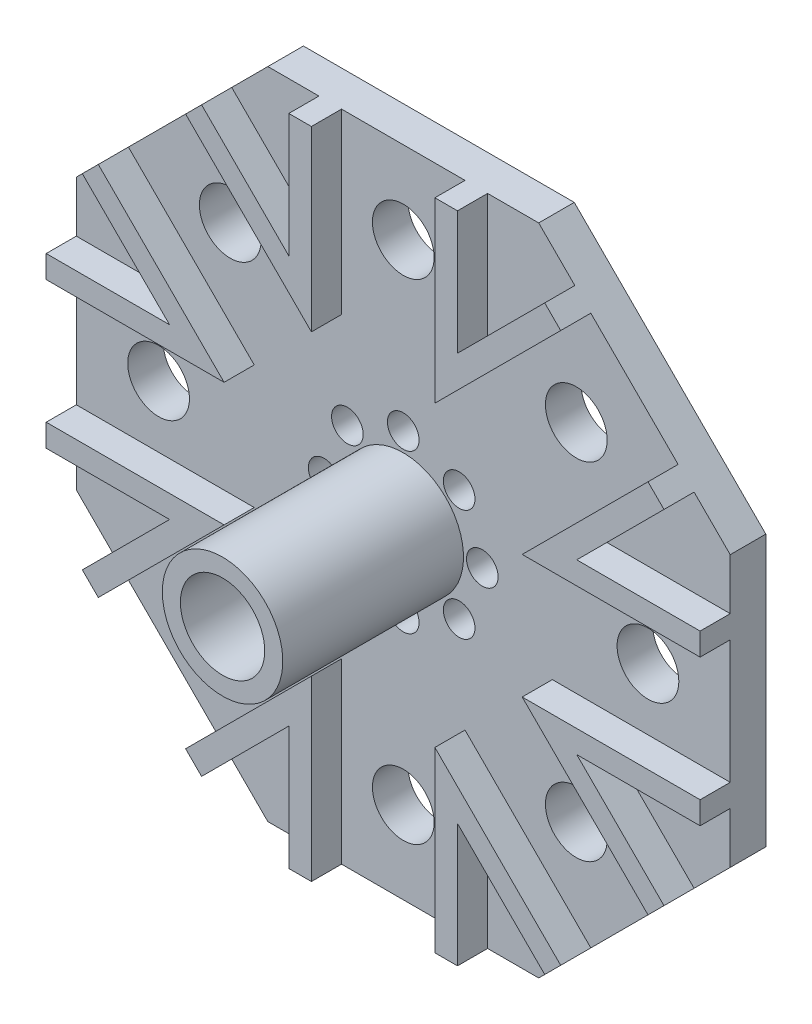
ISO-10303-21;
HEADER;
FILE_DESCRIPTION(('STEP AP214'),'2;1');
FILE_NAME('part.step','',(''),(''),'','','');
FILE_SCHEMA(('AUTOMOTIVE_DESIGN { 1 0 10303 214 1 1 1 1 }'));
ENDSEC;
DATA;
#1=APPLICATION_CONTEXT('core data for automotive mechanical design processes');
#2=APPLICATION_PROTOCOL_DEFINITION('international standard','automotive_design',2000,#1);
#3=PRODUCT_CONTEXT('',#1,'mechanical');
#4=PRODUCT('Part','Part','',(#3));
#5=PRODUCT_RELATED_PRODUCT_CATEGORY('part','',(#4));
#6=PRODUCT_DEFINITION_FORMATION('','',#4);
#7=PRODUCT_DEFINITION_CONTEXT('part definition',#1,'design');
#8=PRODUCT_DEFINITION('design','',#6,#7);
#9=PRODUCT_DEFINITION_SHAPE('','',#8);
#10=(LENGTH_UNIT() NAMED_UNIT(*) SI_UNIT(.MILLI.,.METRE.));
#11=(NAMED_UNIT(*) PLANE_ANGLE_UNIT() SI_UNIT($,.RADIAN.));
#12=(NAMED_UNIT(*) SI_UNIT($,.STERADIAN.) SOLID_ANGLE_UNIT());
#13=UNCERTAINTY_MEASURE_WITH_UNIT(LENGTH_MEASURE(1.E-05),#10,'distance_accuracy_value','');
#14=(GEOMETRIC_REPRESENTATION_CONTEXT(3) GLOBAL_UNCERTAINTY_ASSIGNED_CONTEXT((#13)) GLOBAL_UNIT_ASSIGNED_CONTEXT((#10,
#11,#12)) REPRESENTATION_CONTEXT('',''));
#15=CARTESIAN_POINT('',(0.,0.,0.));
#16=DIRECTION('',(0.,0.,1.));
#17=DIRECTION('',(1.,0.,0.));
#18=AXIS2_PLACEMENT_3D('',#15,#16,#17);
#19=CARTESIAN_POINT('',(-7.11199999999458,-16.1530610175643,5.54));
#20=DIRECTION('',(0.,1.,0.));
#21=DIRECTION('',(-1.,0.,0.));
#22=AXIS2_PLACEMENT_3D('',#19,#20,#21);
#23=PLANE('',#22);
#24=DIRECTION('',(1.,0.,0.));
#25=VECTOR('',#24,1.);
#26=CARTESIAN_POINT('',(-7.11199999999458,-16.1530610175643,3.));
#27=LINE('',#26,#25);
#28=CARTESIAN_POINT('',(-7.11199999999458,-16.1530610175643,3.));
#29=VERTEX_POINT('',#28);
#30=CARTESIAN_POINT('',(-5.20699999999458,-16.1530610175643,3.));
#31=VERTEX_POINT('',#30);
#32=EDGE_CURVE('E129',#29,#31,#27,.T.);
#33=ORIENTED_EDGE('',*,*,#32,.T.);
#34=DIRECTION('',(0.,0.,-1.));
#35=VECTOR('',#34,1.);
#36=CARTESIAN_POINT('',(-5.20699999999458,-16.1530610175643,5.54));
#37=LINE('',#36,#35);
#38=CARTESIAN_POINT('',(-5.20699999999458,-16.1530610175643,5.54));
#39=VERTEX_POINT('',#38);
#40=EDGE_CURVE('E12',#39,#31,#37,.T.);
#41=ORIENTED_EDGE('',*,*,#40,.F.);
#42=DIRECTION('',(1.,0.,0.));
#43=VECTOR('',#42,1.);
#44=CARTESIAN_POINT('',(-7.11199999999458,-16.1530610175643,5.54));
#45=LINE('',#44,#43);
#46=CARTESIAN_POINT('',(-7.11199999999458,-16.1530610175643,5.54));
#47=VERTEX_POINT('',#46);
#48=EDGE_CURVE('E139',#47,#39,#45,.T.);
#49=ORIENTED_EDGE('',*,*,#48,.F.);
#50=DIRECTION('',(0.,0.,-1.));
#51=VECTOR('',#50,1.);
#52=CARTESIAN_POINT('',(-7.11199999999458,-16.1530610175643,5.54));
#53=LINE('',#52,#51);
#54=EDGE_CURVE('E125',#47,#29,#53,.T.);
#55=ORIENTED_EDGE('',*,*,#54,.T.);
#56=EDGE_LOOP('',(#33,#41,#49,#55));
#57=FACE_BOUND('',#56,.T.);
#58=ADVANCED_FACE('F45',(#57),#23,.F.);
#59=CARTESIAN_POINT('',(-5.20699999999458,-16.1530610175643,5.54));
#60=DIRECTION('',(-1.,0.,0.));
#61=DIRECTION('',(0.,-1.,0.));
#62=AXIS2_PLACEMENT_3D('',#59,#60,#61);
#63=PLANE('',#62);
#64=DIRECTION('',(0.,1.,0.));
#65=VECTOR('',#64,1.);
#66=CARTESIAN_POINT('',(-5.20699999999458,-16.1530610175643,3.));
#67=LINE('',#66,#65);
#68=CARTESIAN_POINT('',(-5.20699999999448,-1.14887103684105,3.));
#69=VERTEX_POINT('',#68);
#70=EDGE_CURVE('E132',#31,#69,#67,.T.);
#71=ORIENTED_EDGE('',*,*,#70,.T.);
#72=DIRECTION('',(0.,0.,-1.));
#73=VECTOR('',#72,1.);
#74=CARTESIAN_POINT('',(-5.20699999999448,-1.14887103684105,5.54));
#75=LINE('',#74,#73);
#76=CARTESIAN_POINT('',(-5.20699999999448,-1.14887103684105,5.54));
#77=VERTEX_POINT('',#76);
#78=EDGE_CURVE('E53',#77,#69,#75,.T.);
#79=ORIENTED_EDGE('',*,*,#78,.F.);
#80=DIRECTION('',(0.,1.,0.));
#81=VECTOR('',#80,1.);
#82=CARTESIAN_POINT('',(-5.20699999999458,-16.1530610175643,5.54));
#83=LINE('',#82,#81);
#84=EDGE_CURVE('E98',#39,#77,#83,.T.);
#85=ORIENTED_EDGE('',*,*,#84,.F.);
#86=ORIENTED_EDGE('',*,*,#40,.T.);
#87=EDGE_LOOP('',(#71,#79,#85,#86));
#88=FACE_BOUND('',#87,.T.);
#89=ADVANCED_FACE('F163',(#88),#63,.F.);
#90=CARTESIAN_POINT('',(-5.20699999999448,-1.14887103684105,5.54));
#91=DIRECTION('',(0.707106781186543,-0.707106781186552,0.));
#92=DIRECTION('',(0.707106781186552,0.707106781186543,0.));
#93=AXIS2_PLACEMENT_3D('',#90,#91,#92);
#94=PLANE('',#93);
#95=DIRECTION('',(-0.707106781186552,-0.707106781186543,0.));
#96=VECTOR('',#95,1.);
#97=CARTESIAN_POINT('',(-5.20699999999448,-1.14887103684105,3.));
#98=LINE('',#97,#96);
#99=CARTESIAN_POINT('',(-15.8165644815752,-11.7584355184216,3.));
#100=VERTEX_POINT('',#99);
#101=EDGE_CURVE('E134',#69,#100,#98,.T.);
#102=ORIENTED_EDGE('',*,*,#101,.T.);
#103=DIRECTION('',(0.,0.,-1.));
#104=VECTOR('',#103,1.);
#105=CARTESIAN_POINT('',(-15.8165644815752,-11.7584355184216,5.54));
#106=LINE('',#105,#104);
#107=CARTESIAN_POINT('',(-15.8165644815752,-11.7584355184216,5.54));
#108=VERTEX_POINT('',#107);
#109=EDGE_CURVE('E120',#108,#100,#106,.T.);
#110=ORIENTED_EDGE('',*,*,#109,.F.);
#111=DIRECTION('',(-0.707106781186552,-0.707106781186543,0.));
#112=VECTOR('',#111,1.);
#113=CARTESIAN_POINT('',(-5.20699999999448,-1.14887103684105,5.54));
#114=LINE('',#113,#112);
#115=EDGE_CURVE('E111',#77,#108,#114,.T.);
#116=ORIENTED_EDGE('',*,*,#115,.F.);
#117=ORIENTED_EDGE('',*,*,#78,.T.);
#118=EDGE_LOOP('',(#102,#110,#116,#117));
#119=FACE_BOUND('',#118,.T.);
#120=ADVANCED_FACE('F145',(#119),#94,.F.);
#121=CARTESIAN_POINT('',(-14.4695260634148,-13.105473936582,5.54));
#122=DIRECTION('',(0.707106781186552,0.707106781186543,0.));
#123=DIRECTION('',(-0.707106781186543,0.707106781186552,0.));
#124=AXIS2_PLACEMENT_3D('',#121,#122,#123);
#125=PLANE('',#124);
#126=DIRECTION('',(0.707106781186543,-0.707106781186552,0.));
#127=VECTOR('',#126,1.);
#128=CARTESIAN_POINT('',(-14.4695260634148,-13.105473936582,3.));
#129=LINE('',#128,#127);
#130=CARTESIAN_POINT('',(-14.4695260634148,-13.105473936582,3.));
#131=VERTEX_POINT('',#130);
#132=EDGE_CURVE('E119',#100,#131,#129,.T.);
#133=ORIENTED_EDGE('',*,*,#132,.T.);
#134=DIRECTION('',(0.,0.,-1.));
#135=VECTOR('',#134,1.);
#136=CARTESIAN_POINT('',(-14.4695260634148,-13.105473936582,5.54));
#137=LINE('',#136,#135);
#138=CARTESIAN_POINT('',(-14.4695260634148,-13.105473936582,5.54));
#139=VERTEX_POINT('',#138);
#140=EDGE_CURVE('E116',#139,#131,#137,.T.);
#141=ORIENTED_EDGE('',*,*,#140,.F.);
#142=DIRECTION('',(0.707106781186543,-0.707106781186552,0.));
#143=VECTOR('',#142,1.);
#144=CARTESIAN_POINT('',(-14.4695260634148,-13.105473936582,5.54));
#145=LINE('',#144,#143);
#146=EDGE_CURVE('E105',#108,#139,#145,.T.);
#147=ORIENTED_EDGE('',*,*,#146,.F.);
#148=ORIENTED_EDGE('',*,*,#109,.T.);
#149=EDGE_LOOP('',(#133,#141,#147,#148));
#150=FACE_BOUND('',#149,.T.);
#151=ADVANCED_FACE('F117',(#150),#125,.F.);
#152=CARTESIAN_POINT('',(-7.11199999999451,-5.74794787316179,5.54));
#153=DIRECTION('',(-0.707106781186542,0.707106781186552,0.));
#154=DIRECTION('',(-0.707106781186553,-0.707106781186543,0.));
#155=AXIS2_PLACEMENT_3D('',#152,#153,#154);
#156=PLANE('',#155);
#157=DIRECTION('',(0.707106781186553,0.707106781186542,0.));
#158=VECTOR('',#157,1.);
#159=CARTESIAN_POINT('',(-7.11199999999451,-5.74794787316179,3.));
#160=LINE('',#159,#158);
#161=CARTESIAN_POINT('',(-7.11199999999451,-5.74794787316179,3.));
#162=VERTEX_POINT('',#161);
#163=EDGE_CURVE('E84',#131,#162,#160,.T.);
#164=ORIENTED_EDGE('',*,*,#163,.T.);
#165=DIRECTION('',(0.,0.,-1.));
#166=VECTOR('',#165,1.);
#167=CARTESIAN_POINT('',(-7.11199999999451,-5.74794787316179,5.54));
#168=LINE('',#167,#166);
#169=CARTESIAN_POINT('',(-7.11199999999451,-5.74794787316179,5.54));
#170=VERTEX_POINT('',#169);
#171=EDGE_CURVE('E121',#170,#162,#168,.T.);
#172=ORIENTED_EDGE('',*,*,#171,.F.);
#173=DIRECTION('',(0.707106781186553,0.707106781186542,0.));
#174=VECTOR('',#173,1.);
#175=CARTESIAN_POINT('',(-7.11199999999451,-5.74794787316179,5.54));
#176=LINE('',#175,#174);
#177=EDGE_CURVE('E109',#139,#170,#176,.T.);
#178=ORIENTED_EDGE('',*,*,#177,.F.);
#179=ORIENTED_EDGE('',*,*,#140,.T.);
#180=EDGE_LOOP('',(#164,#172,#178,#179));
#181=FACE_BOUND('',#180,.T.);
#182=ADVANCED_FACE('F123',(#181),#156,.F.);
#183=CARTESIAN_POINT('',(-7.11199999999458,-16.1530610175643,5.54));
#184=DIRECTION('',(1.,0.,0.));
#185=DIRECTION('',(0.,1.,0.));
#186=AXIS2_PLACEMENT_3D('',#183,#184,#185);
#187=PLANE('',#186);
#188=DIRECTION('',(0.,-1.,0.));
#189=VECTOR('',#188,1.);
#190=CARTESIAN_POINT('',(-7.11199999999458,-16.1530610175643,3.));
#191=LINE('',#190,#189);
#192=EDGE_CURVE('E90',#162,#29,#191,.T.);
#193=ORIENTED_EDGE('',*,*,#192,.T.);
#194=ORIENTED_EDGE('',*,*,#54,.F.);
#195=DIRECTION('',(0.,-1.,0.));
#196=VECTOR('',#195,1.);
#197=CARTESIAN_POINT('',(-7.11199999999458,-16.1530610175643,5.54));
#198=LINE('',#197,#196);
#199=EDGE_CURVE('E61',#170,#47,#198,.T.);
#200=ORIENTED_EDGE('',*,*,#199,.F.);
#201=ORIENTED_EDGE('',*,*,#171,.T.);
#202=EDGE_LOOP('',(#193,#194,#200,#201));
#203=FACE_BOUND('',#202,.T.);
#204=ADVANCED_FACE('F152',(#203),#187,.F.);
#205=CARTESIAN_POINT('',(0.,0.,5.54));
#206=DIRECTION('',(0.,0.,1.));
#207=DIRECTION('',(1.,0.,0.));
#208=AXIS2_PLACEMENT_3D('',#205,#206,#207);
#209=PLANE('',#208);
#210=ORIENTED_EDGE('',*,*,#48,.T.);
#211=ORIENTED_EDGE('',*,*,#84,.T.);
#212=ORIENTED_EDGE('',*,*,#115,.T.);
#213=ORIENTED_EDGE('',*,*,#146,.T.);
#214=ORIENTED_EDGE('',*,*,#177,.T.);
#215=ORIENTED_EDGE('',*,*,#199,.T.);
#216=EDGE_LOOP('',(#210,#211,#212,#213,#214,#215));
#217=FACE_BOUND('',#216,.T.);
#218=ADVANCED_FACE('F107',(#217),#209,.T.);
#219=CARTESIAN_POINT('',(0.,0.,3.));
#220=DIRECTION('',(0.,0.,1.));
#221=DIRECTION('',(1.,0.,0.));
#222=AXIS2_PLACEMENT_3D('',#219,#220,#221);
#223=PLANE('',#222);
#224=ORIENTED_EDGE('',*,*,#32,.F.);
#225=ORIENTED_EDGE('',*,*,#192,.F.);
#226=ORIENTED_EDGE('',*,*,#163,.F.);
#227=ORIENTED_EDGE('',*,*,#132,.F.);
#228=ORIENTED_EDGE('',*,*,#101,.F.);
#229=ORIENTED_EDGE('',*,*,#70,.F.);
#230=EDGE_LOOP('',(#224,#225,#226,#227,#228,#229));
#231=FACE_BOUND('',#230,.T.);
#232=ADVANCED_FACE('F148',(#231),#223,.F.);
#233=CLOSED_SHELL('',(#58,#89,#120,#151,#182,#204,#218,#232));
#234=MANIFOLD_SOLID_BREP('B2',#233);
#235=CARTESIAN_POINT('',(14.4695260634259,-13.1054739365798,5.54));
#236=DIRECTION('',(-0.707106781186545,0.70710678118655,0.));
#237=DIRECTION('',(-0.70710678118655,-0.707106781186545,0.));
#238=AXIS2_PLACEMENT_3D('',#235,#236,#237);
#239=PLANE('',#238);
#240=DIRECTION('',(0.70710678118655,0.707106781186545,0.));
#241=VECTOR('',#240,1.);
#242=CARTESIAN_POINT('',(14.4695260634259,-13.1054739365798,3.));
#243=LINE('',#242,#241);
#244=CARTESIAN_POINT('',(14.4695260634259,-13.1054739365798,3.));
#245=VERTEX_POINT('',#244);
#246=CARTESIAN_POINT('',(15.8165644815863,-11.7584355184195,3.));
#247=VERTEX_POINT('',#246);
#248=EDGE_CURVE('E313',#245,#247,#243,.T.);
#249=ORIENTED_EDGE('',*,*,#248,.T.);
#250=DIRECTION('',(0.,0.,-1.));
#251=VECTOR('',#250,1.);
#252=CARTESIAN_POINT('',(15.8165644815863,-11.7584355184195,5.54));
#253=LINE('',#252,#251);
#254=CARTESIAN_POINT('',(15.8165644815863,-11.7584355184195,5.54));
#255=VERTEX_POINT('',#254);
#256=EDGE_CURVE('E43',#255,#247,#253,.T.);
#257=ORIENTED_EDGE('',*,*,#256,.F.);
#258=DIRECTION('',(0.70710678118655,0.707106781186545,0.));
#259=VECTOR('',#258,1.);
#260=CARTESIAN_POINT('',(14.4695260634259,-13.1054739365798,5.54));
#261=LINE('',#260,#259);
#262=CARTESIAN_POINT('',(14.4695260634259,-13.1054739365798,5.54));
#263=VERTEX_POINT('',#262);
#264=EDGE_CURVE('E323',#263,#255,#261,.T.);
#265=ORIENTED_EDGE('',*,*,#264,.F.);
#266=DIRECTION('',(0.,0.,-1.));
#267=VECTOR('',#266,1.);
#268=CARTESIAN_POINT('',(14.4695260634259,-13.1054739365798,5.54));
#269=LINE('',#268,#267);
#270=EDGE_CURVE('E309',#263,#245,#269,.T.);
#271=ORIENTED_EDGE('',*,*,#270,.T.);
#272=EDGE_LOOP('',(#249,#257,#265,#271));
#273=FACE_BOUND('',#272,.T.);
#274=ADVANCED_FACE('F229',(#273),#239,.F.);
#275=CARTESIAN_POINT('',(15.8165644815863,-11.7584355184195,5.54));
#276=DIRECTION('',(-0.707106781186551,-0.707106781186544,0.));
#277=DIRECTION('',(0.707106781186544,-0.707106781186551,0.));
#278=AXIS2_PLACEMENT_3D('',#275,#276,#277);
#279=PLANE('',#278);
#280=DIRECTION('',(-0.707106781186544,0.707106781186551,0.));
#281=VECTOR('',#280,1.);
#282=CARTESIAN_POINT('',(15.8165644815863,-11.7584355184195,3.));
#283=LINE('',#282,#281);
#284=CARTESIAN_POINT('',(5.20700000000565,-1.14887103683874,3.));
#285=VERTEX_POINT('',#284);
#286=EDGE_CURVE('E316',#247,#285,#283,.T.);
#287=ORIENTED_EDGE('',*,*,#286,.T.);
#288=DIRECTION('',(0.,0.,-1.));
#289=VECTOR('',#288,1.);
#290=CARTESIAN_POINT('',(5.20700000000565,-1.14887103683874,5.54));
#291=LINE('',#290,#289);
#292=CARTESIAN_POINT('',(5.20700000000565,-1.14887103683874,5.54));
#293=VERTEX_POINT('',#292);
#294=EDGE_CURVE('E237',#293,#285,#291,.T.);
#295=ORIENTED_EDGE('',*,*,#294,.F.);
#296=DIRECTION('',(-0.707106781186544,0.707106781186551,0.));
#297=VECTOR('',#296,1.);
#298=CARTESIAN_POINT('',(15.8165644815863,-11.7584355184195,5.54));
#299=LINE('',#298,#297);
#300=EDGE_CURVE('E282',#255,#293,#299,.T.);
#301=ORIENTED_EDGE('',*,*,#300,.F.);
#302=ORIENTED_EDGE('',*,*,#256,.T.);
#303=EDGE_LOOP('',(#287,#295,#301,#302));
#304=FACE_BOUND('',#303,.T.);
#305=ADVANCED_FACE('F347',(#304),#279,.F.);
#306=CARTESIAN_POINT('',(5.20700000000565,-1.14887103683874,5.54));
#307=DIRECTION('',(1.,0.,0.));
#308=DIRECTION('',(0.,1.,0.));
#309=AXIS2_PLACEMENT_3D('',#306,#307,#308);
#310=PLANE('',#309);
#311=DIRECTION('',(0.,-1.,0.));
#312=VECTOR('',#311,1.);
#313=CARTESIAN_POINT('',(5.20700000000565,-1.14887103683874,3.));
#314=LINE('',#313,#312);
#315=CARTESIAN_POINT('',(5.20700000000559,-16.153061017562,3.));
#316=VERTEX_POINT('',#315);
#317=EDGE_CURVE('E318',#285,#316,#314,.T.);
#318=ORIENTED_EDGE('',*,*,#317,.T.);
#319=DIRECTION('',(0.,0.,-1.));
#320=VECTOR('',#319,1.);
#321=CARTESIAN_POINT('',(5.20700000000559,-16.153061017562,5.54));
#322=LINE('',#321,#320);
#323=CARTESIAN_POINT('',(5.20700000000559,-16.153061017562,5.54));
#324=VERTEX_POINT('',#323);
#325=EDGE_CURVE('E304',#324,#316,#322,.T.);
#326=ORIENTED_EDGE('',*,*,#325,.F.);
#327=DIRECTION('',(0.,-1.,0.));
#328=VECTOR('',#327,1.);
#329=CARTESIAN_POINT('',(5.20700000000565,-1.14887103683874,5.54));
#330=LINE('',#329,#328);
#331=EDGE_CURVE('E295',#293,#324,#330,.T.);
#332=ORIENTED_EDGE('',*,*,#331,.F.);
#333=ORIENTED_EDGE('',*,*,#294,.T.);
#334=EDGE_LOOP('',(#318,#326,#332,#333));
#335=FACE_BOUND('',#334,.T.);
#336=ADVANCED_FACE('F329',(#335),#310,.F.);
#337=CARTESIAN_POINT('',(7.11200000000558,-16.153061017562,5.54));
#338=DIRECTION('',(0.,1.,0.));
#339=DIRECTION('',(-1.,0.,0.));
#340=AXIS2_PLACEMENT_3D('',#337,#338,#339);
#341=PLANE('',#340);
#342=DIRECTION('',(1.,0.,0.));
#343=VECTOR('',#342,1.);
#344=CARTESIAN_POINT('',(7.11200000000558,-16.153061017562,3.));
#345=LINE('',#344,#343);
#346=CARTESIAN_POINT('',(7.11200000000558,-16.153061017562,3.));
#347=VERTEX_POINT('',#346);
#348=EDGE_CURVE('E303',#316,#347,#345,.T.);
#349=ORIENTED_EDGE('',*,*,#348,.T.);
#350=DIRECTION('',(0.,0.,-1.));
#351=VECTOR('',#350,1.);
#352=CARTESIAN_POINT('',(7.11200000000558,-16.153061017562,5.54));
#353=LINE('',#352,#351);
#354=CARTESIAN_POINT('',(7.11200000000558,-16.153061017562,5.54));
#355=VERTEX_POINT('',#354);
#356=EDGE_CURVE('E300',#355,#347,#353,.T.);
#357=ORIENTED_EDGE('',*,*,#356,.F.);
#358=DIRECTION('',(1.,0.,0.));
#359=VECTOR('',#358,1.);
#360=CARTESIAN_POINT('',(7.11200000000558,-16.153061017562,5.54));
#361=LINE('',#360,#359);
#362=EDGE_CURVE('E289',#324,#355,#361,.T.);
#363=ORIENTED_EDGE('',*,*,#362,.F.);
#364=ORIENTED_EDGE('',*,*,#325,.T.);
#365=EDGE_LOOP('',(#349,#357,#363,#364));
#366=FACE_BOUND('',#365,.T.);
#367=ADVANCED_FACE('F301',(#366),#341,.F.);
#368=CARTESIAN_POINT('',(7.11200000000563,-5.7479478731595,5.54));
#369=DIRECTION('',(-1.,0.,0.));
#370=DIRECTION('',(0.,-1.,0.));
#371=AXIS2_PLACEMENT_3D('',#368,#369,#370);
#372=PLANE('',#371);
#373=DIRECTION('',(0.,1.,0.));
#374=VECTOR('',#373,1.);
#375=CARTESIAN_POINT('',(7.11200000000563,-5.7479478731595,3.));
#376=LINE('',#375,#374);
#377=CARTESIAN_POINT('',(7.11200000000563,-5.7479478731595,3.));
#378=VERTEX_POINT('',#377);
#379=EDGE_CURVE('E268',#347,#378,#376,.T.);
#380=ORIENTED_EDGE('',*,*,#379,.T.);
#381=DIRECTION('',(0.,0.,-1.));
#382=VECTOR('',#381,1.);
#383=CARTESIAN_POINT('',(7.11200000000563,-5.7479478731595,5.54));
#384=LINE('',#383,#382);
#385=CARTESIAN_POINT('',(7.11200000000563,-5.7479478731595,5.54));
#386=VERTEX_POINT('',#385);
#387=EDGE_CURVE('E305',#386,#378,#384,.T.);
#388=ORIENTED_EDGE('',*,*,#387,.F.);
#389=DIRECTION('',(0.,1.,0.));
#390=VECTOR('',#389,1.);
#391=CARTESIAN_POINT('',(7.11200000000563,-5.7479478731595,5.54));
#392=LINE('',#391,#390);
#393=EDGE_CURVE('E293',#355,#386,#392,.T.);
#394=ORIENTED_EDGE('',*,*,#393,.F.);
#395=ORIENTED_EDGE('',*,*,#356,.T.);
#396=EDGE_LOOP('',(#380,#388,#394,#395));
#397=FACE_BOUND('',#396,.T.);
#398=ADVANCED_FACE('F307',(#397),#372,.F.);
#399=CARTESIAN_POINT('',(14.4695260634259,-13.1054739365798,5.54));
#400=DIRECTION('',(0.707106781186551,0.707106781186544,0.));
#401=DIRECTION('',(-0.707106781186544,0.707106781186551,0.));
#402=AXIS2_PLACEMENT_3D('',#399,#400,#401);
#403=PLANE('',#402);
#404=DIRECTION('',(0.707106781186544,-0.707106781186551,0.));
#405=VECTOR('',#404,1.);
#406=CARTESIAN_POINT('',(14.4695260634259,-13.1054739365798,3.));
#407=LINE('',#406,#405);
#408=EDGE_CURVE('E274',#378,#245,#407,.T.);
#409=ORIENTED_EDGE('',*,*,#408,.T.);
#410=ORIENTED_EDGE('',*,*,#270,.F.);
#411=DIRECTION('',(0.707106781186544,-0.707106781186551,0.));
#412=VECTOR('',#411,1.);
#413=CARTESIAN_POINT('',(14.4695260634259,-13.1054739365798,5.54));
#414=LINE('',#413,#412);
#415=EDGE_CURVE('E245',#386,#263,#414,.T.);
#416=ORIENTED_EDGE('',*,*,#415,.F.);
#417=ORIENTED_EDGE('',*,*,#387,.T.);
#418=EDGE_LOOP('',(#409,#410,#416,#417));
#419=FACE_BOUND('',#418,.T.);
#420=ADVANCED_FACE('F336',(#419),#403,.F.);
#421=CARTESIAN_POINT('',(0.,0.,5.54));
#422=DIRECTION('',(0.,0.,1.));
#423=DIRECTION('',(1.,0.,0.));
#424=AXIS2_PLACEMENT_3D('',#421,#422,#423);
#425=PLANE('',#424);
#426=ORIENTED_EDGE('',*,*,#264,.T.);
#427=ORIENTED_EDGE('',*,*,#300,.T.);
#428=ORIENTED_EDGE('',*,*,#331,.T.);
#429=ORIENTED_EDGE('',*,*,#362,.T.);
#430=ORIENTED_EDGE('',*,*,#393,.T.);
#431=ORIENTED_EDGE('',*,*,#415,.T.);
#432=EDGE_LOOP('',(#426,#427,#428,#429,#430,#431));
#433=FACE_BOUND('',#432,.T.);
#434=ADVANCED_FACE('F291',(#433),#425,.T.);
#435=CARTESIAN_POINT('',(0.,0.,3.));
#436=DIRECTION('',(0.,0.,1.));
#437=DIRECTION('',(1.,0.,0.));
#438=AXIS2_PLACEMENT_3D('',#435,#436,#437);
#439=PLANE('',#438);
#440=ORIENTED_EDGE('',*,*,#248,.F.);
#441=ORIENTED_EDGE('',*,*,#408,.F.);
#442=ORIENTED_EDGE('',*,*,#379,.F.);
#443=ORIENTED_EDGE('',*,*,#348,.F.);
#444=ORIENTED_EDGE('',*,*,#317,.F.);
#445=ORIENTED_EDGE('',*,*,#286,.F.);
#446=EDGE_LOOP('',(#440,#441,#442,#443,#444,#445));
#447=FACE_BOUND('',#446,.T.);
#448=ADVANCED_FACE('F332',(#447),#439,.F.);
#449=CLOSED_SHELL('',(#274,#305,#336,#367,#398,#420,#434,#448));
#450=MANIFOLD_SOLID_BREP('B6',#449);
#451=CARTESIAN_POINT('',(27.575,22.8438779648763,3.));
#452=DIRECTION('',(-1.,0.,0.));
#453=DIRECTION('',(0.,-1.,0.));
#454=AXIS2_PLACEMENT_3D('',#451,#452,#453);
#455=PLANE('',#454);
#456=DIRECTION('',(0.,1.,0.));
#457=VECTOR('',#456,1.);
#458=CARTESIAN_POINT('',(27.575,22.8438779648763,0.));
#459=LINE('',#458,#457);
#460=CARTESIAN_POINT('',(27.575,0.,0.));
#461=VERTEX_POINT('',#460);
#462=CARTESIAN_POINT('',(27.575,22.8438779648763,0.));
#463=VERTEX_POINT('',#462);
#464=EDGE_CURVE('E1070',#461,#463,#459,.T.);
#465=ORIENTED_EDGE('',*,*,#464,.T.);
#466=DIRECTION('',(0.,0.,-1.));
#467=VECTOR('',#466,1.);
#468=CARTESIAN_POINT('',(27.575,22.8438779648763,3.));
#469=LINE('',#468,#467);
#470=CARTESIAN_POINT('',(27.575,22.8438779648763,3.));
#471=VERTEX_POINT('',#470);
#472=EDGE_CURVE('E1086',#471,#463,#469,.T.);
#473=ORIENTED_EDGE('',*,*,#472,.F.);
#474=DIRECTION('',(0.,1.,0.));
#475=VECTOR('',#474,1.);
#476=CARTESIAN_POINT('',(27.575,22.8438779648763,3.));
#477=LINE('',#476,#475);
#478=CARTESIAN_POINT('',(27.575,18.5339389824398,3.));
#479=VERTEX_POINT('',#478);
#480=EDGE_CURVE('E1050',#479,#471,#477,.T.);
#481=ORIENTED_EDGE('',*,*,#480,.F.);
#482=DIRECTION('',(0.,0.,-1.));
#483=VECTOR('',#482,1.);
#484=CARTESIAN_POINT('',(27.5750000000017,18.5339389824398,5.54));
#485=LINE('',#484,#483);
#486=CARTESIAN_POINT('',(27.5750000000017,18.5339389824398,5.54));
#487=VERTEX_POINT('',#486);
#488=EDGE_CURVE('E917',#487,#479,#485,.T.);
#489=ORIENTED_EDGE('',*,*,#488,.F.);
#490=DIRECTION('',(0.,1.,0.));
#491=VECTOR('',#490,1.);
#492=CARTESIAN_POINT('',(27.5750000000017,18.5339389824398,5.54));
#493=LINE('',#492,#491);
#494=CARTESIAN_POINT('',(27.5750000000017,16.6289389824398,5.54));
#495=VERTEX_POINT('',#494);
#496=EDGE_CURVE('E895',#495,#487,#493,.T.);
#497=ORIENTED_EDGE('',*,*,#496,.F.);
#498=DIRECTION('',(0.,0.,-1.));
#499=VECTOR('',#498,1.);
#500=CARTESIAN_POINT('',(27.5750000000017,16.6289389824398,5.54));
#501=LINE('',#500,#499);
#502=CARTESIAN_POINT('',(27.575,16.6289389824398,3.));
#503=VERTEX_POINT('',#502);
#504=EDGE_CURVE('E920',#495,#503,#501,.T.);
#505=ORIENTED_EDGE('',*,*,#504,.T.);
#506=CARTESIAN_POINT('',(27.5750000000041,6.21493898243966,3.));
#507=VERTEX_POINT('',#506);
#508=EDGE_CURVE('E1056',#507,#503,#477,.T.);
#509=ORIENTED_EDGE('',*,*,#508,.F.);
#510=DIRECTION('',(0.,0.,-1.));
#511=VECTOR('',#510,1.);
#512=CARTESIAN_POINT('',(27.5750000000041,6.21493898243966,5.54));
#513=LINE('',#512,#511);
#514=CARTESIAN_POINT('',(27.5750000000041,6.21493898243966,5.54));
#515=VERTEX_POINT('',#514);
#516=EDGE_CURVE('E883',#515,#507,#513,.T.);
#517=ORIENTED_EDGE('',*,*,#516,.F.);
#518=DIRECTION('',(0.,1.,0.));
#519=VECTOR('',#518,1.);
#520=CARTESIAN_POINT('',(27.575000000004,4.30993898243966,5.54));
#521=LINE('',#520,#519);
#522=CARTESIAN_POINT('',(27.575000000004,4.30993898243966,5.54));
#523=VERTEX_POINT('',#522);
#524=EDGE_CURVE('E846',#523,#515,#521,.T.);
#525=ORIENTED_EDGE('',*,*,#524,.F.);
#526=DIRECTION('',(0.,0.,-1.));
#527=VECTOR('',#526,1.);
#528=CARTESIAN_POINT('',(27.575000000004,4.30993898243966,5.54));
#529=LINE('',#528,#527);
#530=CARTESIAN_POINT('',(27.575,4.30993898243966,3.));
#531=VERTEX_POINT('',#530);
#532=EDGE_CURVE('E860',#523,#531,#529,.T.);
#533=ORIENTED_EDGE('',*,*,#532,.T.);
#534=CARTESIAN_POINT('',(27.575,0.,3.));
#535=VERTEX_POINT('',#534);
#536=EDGE_CURVE('E1053',#535,#531,#477,.T.);
#537=ORIENTED_EDGE('',*,*,#536,.F.);
#538=DIRECTION('',(0.,0.,-1.));
#539=VECTOR('',#538,1.);
#540=CARTESIAN_POINT('',(27.575,0.,3.));
#541=LINE('',#540,#539);
#542=EDGE_CURVE('E1089',#535,#461,#541,.T.);
#543=ORIENTED_EDGE('',*,*,#542,.T.);
#544=EDGE_LOOP('',(#465,#473,#481,#489,#497,#505,#509,#517,#525,#533,#537,#543));
#545=FACE_BOUND('',#544,.T.);
#546=ADVANCED_FACE('F404',(#545),#455,.F.);
#547=CARTESIAN_POINT('',(-27.575,0.,3.));
#548=DIRECTION('',(1.,0.,0.));
#549=DIRECTION('',(0.,1.,0.));
#550=AXIS2_PLACEMENT_3D('',#547,#548,#549);
#551=PLANE('',#550);
#552=DIRECTION('',(0.,-1.,0.));
#553=VECTOR('',#552,1.);
#554=CARTESIAN_POINT('',(-27.575,0.,0.));
#555=LINE('',#554,#553);
#556=CARTESIAN_POINT('',(-27.575,22.8438779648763,0.));
#557=VERTEX_POINT('',#556);
#558=CARTESIAN_POINT('',(-27.575,0.,0.));
#559=VERTEX_POINT('',#558);
#560=EDGE_CURVE('E1047',#557,#559,#555,.T.);
#561=ORIENTED_EDGE('',*,*,#560,.T.);
#562=DIRECTION('',(0.,0.,-1.));
#563=VECTOR('',#562,1.);
#564=CARTESIAN_POINT('',(-27.575,0.,3.));
#565=LINE('',#564,#563);
#566=CARTESIAN_POINT('',(-27.575,0.,3.));
#567=VERTEX_POINT('',#566);
#568=EDGE_CURVE('E413',#567,#559,#565,.T.);
#569=ORIENTED_EDGE('',*,*,#568,.F.);
#570=DIRECTION('',(0.,-1.,0.));
#571=VECTOR('',#570,1.);
#572=CARTESIAN_POINT('',(-27.575,0.,3.));
#573=LINE('',#572,#571);
#574=CARTESIAN_POINT('',(-27.575,4.30993898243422,3.));
#575=VERTEX_POINT('',#574);
#576=EDGE_CURVE('E1052',#575,#567,#573,.T.);
#577=ORIENTED_EDGE('',*,*,#576,.F.);
#578=DIRECTION('',(0.,0.,-1.));
#579=VECTOR('',#578,1.);
#580=CARTESIAN_POINT('',(-27.5749999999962,4.30993898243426,5.54));
#581=LINE('',#580,#579);
#582=CARTESIAN_POINT('',(-27.5749999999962,4.30993898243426,5.54));
#583=VERTEX_POINT('',#582);
#584=EDGE_CURVE('E833',#583,#575,#581,.T.);
#585=ORIENTED_EDGE('',*,*,#584,.F.);
#586=DIRECTION('',(0.,-1.,0.));
#587=VECTOR('',#586,1.);
#588=CARTESIAN_POINT('',(-27.5749999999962,4.30993898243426,5.54));
#589=LINE('',#588,#587);
#590=CARTESIAN_POINT('',(-27.5749999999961,6.21493898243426,5.54));
#591=VERTEX_POINT('',#590);
#592=EDGE_CURVE('E814',#591,#583,#589,.T.);
#593=ORIENTED_EDGE('',*,*,#592,.F.);
#594=DIRECTION('',(0.,0.,-1.));
#595=VECTOR('',#594,1.);
#596=CARTESIAN_POINT('',(-27.5749999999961,6.21493898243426,5.54));
#597=LINE('',#596,#595);
#598=CARTESIAN_POINT('',(-27.575,6.21493898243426,3.));
#599=VERTEX_POINT('',#598);
#600=EDGE_CURVE('E836',#591,#599,#597,.T.);
#601=ORIENTED_EDGE('',*,*,#600,.T.);
#602=CARTESIAN_POINT('',(-27.575,16.6289389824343,3.));
#603=VERTEX_POINT('',#602);
#604=EDGE_CURVE('E1051',#603,#599,#573,.T.);
#605=ORIENTED_EDGE('',*,*,#604,.F.);
#606=DIRECTION('',(0.,0.,-1.));
#607=VECTOR('',#606,1.);
#608=CARTESIAN_POINT('',(-27.5749999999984,16.6289389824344,5.54));
#609=LINE('',#608,#607);
#610=CARTESIAN_POINT('',(-27.5749999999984,16.6289389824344,5.54));
#611=VERTEX_POINT('',#610);
#612=EDGE_CURVE('E802',#611,#603,#609,.T.);
#613=ORIENTED_EDGE('',*,*,#612,.F.);
#614=DIRECTION('',(0.,-1.,0.));
#615=VECTOR('',#614,1.);
#616=CARTESIAN_POINT('',(-27.5749999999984,18.5339389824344,5.54));
#617=LINE('',#616,#615);
#618=CARTESIAN_POINT('',(-27.5749999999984,18.5339389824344,5.54));
#619=VERTEX_POINT('',#618);
#620=EDGE_CURVE('E763',#619,#611,#617,.T.);
#621=ORIENTED_EDGE('',*,*,#620,.F.);
#622=DIRECTION('',(0.,0.,-1.));
#623=VECTOR('',#622,1.);
#624=CARTESIAN_POINT('',(-27.5749999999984,18.5339389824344,5.54));
#625=LINE('',#624,#623);
#626=CARTESIAN_POINT('',(-27.575,18.5339389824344,3.));
#627=VERTEX_POINT('',#626);
#628=EDGE_CURVE('E777',#619,#627,#625,.T.);
#629=ORIENTED_EDGE('',*,*,#628,.T.);
#630=CARTESIAN_POINT('',(-27.575,22.8438779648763,3.));
#631=VERTEX_POINT('',#630);
#632=EDGE_CURVE('E1048',#631,#627,#573,.T.);
#633=ORIENTED_EDGE('',*,*,#632,.F.);
#634=DIRECTION('',(0.,0.,-1.));
#635=VECTOR('',#634,1.);
#636=CARTESIAN_POINT('',(-27.575,22.8438779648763,3.));
#637=LINE('',#636,#635);
#638=EDGE_CURVE('E1067',#631,#557,#637,.T.);
#639=ORIENTED_EDGE('',*,*,#638,.T.);
#640=EDGE_LOOP('',(#561,#569,#577,#585,#593,#601,#605,#613,#621,#629,#633,#639));
#641=FACE_BOUND('',#640,.T.);
#642=ADVANCED_FACE('F406',(#641),#551,.F.);
#643=CARTESIAN_POINT('',(0.,0.,3.));
#644=DIRECTION('',(0.,0.,-1.));
#645=DIRECTION('',(-1.,0.,0.));
#646=AXIS2_PLACEMENT_3D('',#643,#644,#645);
#647=PLANE('',#646);
#648=CARTESIAN_POINT('',(1.63237479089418E-12,-9.21448813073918,3.));
#649=DIRECTION('',(0.,0.,1.));
#650=DIRECTION('',(1.,0.,0.));
#651=AXIS2_PLACEMENT_3D('',#648,#649,#650);
#652=CIRCLE('',#651,2.6035);
#653=CARTESIAN_POINT('',(2.60350000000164,-9.21448813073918,3.));
#654=VERTEX_POINT('',#653);
#655=EDGE_CURVE('E1111',#654,#654,#652,.T.);
#656=ORIENTED_EDGE('',*,*,#655,.F.);
#657=EDGE_LOOP('',(#656));
#658=FACE_BOUND('',#657,.T.);
#659=CARTESIAN_POINT('',(14.5921575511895,-3.17021856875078,3.));
#660=DIRECTION('',(0.,0.,1.));
#661=DIRECTION('',(1.,0.,0.));
#662=AXIS2_PLACEMENT_3D('',#659,#660,#661);
#663=CIRCLE('',#662,2.6035);
#664=CARTESIAN_POINT('',(17.1956575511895,-3.17021856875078,3.));
#665=VERTEX_POINT('',#664);
#666=EDGE_CURVE('E1116',#665,#665,#663,.T.);
#667=ORIENTED_EDGE('',*,*,#666,.F.);
#668=EDGE_LOOP('',(#667));
#669=FACE_BOUND('',#668,.T.);
#670=CARTESIAN_POINT('',(-14.5921575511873,-3.17021856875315,3.));
#671=DIRECTION('',(0.,0.,1.));
#672=DIRECTION('',(1.,0.,0.));
#673=AXIS2_PLACEMENT_3D('',#670,#671,#672);
#674=CIRCLE('',#673,2.6035);
#675=CARTESIAN_POINT('',(-11.9886575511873,-3.17021856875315,3.));
#676=VERTEX_POINT('',#675);
#677=EDGE_CURVE('E1108',#676,#676,#674,.T.);
#678=ORIENTED_EDGE('',*,*,#677,.F.);
#679=EDGE_LOOP('',(#678));
#680=FACE_BOUND('',#679,.T.);
#681=CARTESIAN_POINT('',(-20.6364271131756,11.4219389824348,3.));
#682=DIRECTION('',(0.,0.,1.));
#683=DIRECTION('',(1.,0.,0.));
#684=AXIS2_PLACEMENT_3D('',#681,#682,#683);
#685=CIRCLE('',#684,2.6035);
#686=CARTESIAN_POINT('',(-18.0329271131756,11.4219389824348,3.));
#687=VERTEX_POINT('',#686);
#688=EDGE_CURVE('E973',#687,#687,#685,.T.);
#689=ORIENTED_EDGE('',*,*,#688,.F.);
#690=EDGE_LOOP('',(#689));
#691=FACE_BOUND('',#690,.T.);
#692=CARTESIAN_POINT('',(-14.5921575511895,26.0140965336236,3.));
#693=DIRECTION('',(0.,0.,1.));
#694=DIRECTION('',(1.,0.,0.));
#695=AXIS2_PLACEMENT_3D('',#692,#693,#694);
#696=CIRCLE('',#695,2.6035);
#697=CARTESIAN_POINT('',(-11.9886575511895,26.0140965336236,3.));
#698=VERTEX_POINT('',#697);
#699=EDGE_CURVE('E977',#698,#698,#696,.T.);
#700=ORIENTED_EDGE('',*,*,#699,.F.);
#701=EDGE_LOOP('',(#700));
#702=FACE_BOUND('',#701,.T.);
#703=CARTESIAN_POINT('',(-1.57512891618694E-12,32.0583660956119,3.));
#704=DIRECTION('',(0.,0.,1.));
#705=DIRECTION('',(1.,0.,0.));
#706=AXIS2_PLACEMENT_3D('',#703,#704,#705);
#707=CIRCLE('',#706,2.60350000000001);
#708=CARTESIAN_POINT('',(2.60349999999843,32.0583660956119,3.));
#709=VERTEX_POINT('',#708);
#710=EDGE_CURVE('E980',#709,#709,#707,.T.);
#711=ORIENTED_EDGE('',*,*,#710,.F.);
#712=EDGE_LOOP('',(#711));
#713=FACE_BOUND('',#712,.T.);
#714=CARTESIAN_POINT('',(14.5921575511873,26.0140965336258,3.));
#715=DIRECTION('',(0.,0.,1.));
#716=DIRECTION('',(1.,0.,0.));
#717=AXIS2_PLACEMENT_3D('',#714,#715,#716);
#718=CIRCLE('',#717,2.6035);
#719=CARTESIAN_POINT('',(17.1956575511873,26.0140965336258,3.));
#720=VERTEX_POINT('',#719);
#721=EDGE_CURVE('E972',#720,#720,#718,.T.);
#722=ORIENTED_EDGE('',*,*,#721,.F.);
#723=EDGE_LOOP('',(#722));
#724=FACE_BOUND('',#723,.T.);
#725=CARTESIAN_POINT('',(20.6364271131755,11.4219389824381,3.));
#726=DIRECTION('',(0.,0.,1.));
#727=DIRECTION('',(1.,0.,0.));
#728=AXIS2_PLACEMENT_3D('',#725,#726,#727);
#729=CIRCLE('',#728,2.6035);
#730=CARTESIAN_POINT('',(23.2399271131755,11.4219389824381,3.));
#731=VERTEX_POINT('',#730);
#732=EDGE_CURVE('E985',#731,#731,#729,.T.);
#733=ORIENTED_EDGE('',*,*,#732,.F.);
#734=EDGE_LOOP('',(#733));
#735=FACE_BOUND('',#734,.T.);
#736=CARTESIAN_POINT('',(4.71387581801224,6.70806316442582,3.));
#737=DIRECTION('',(0.,0.,1.));
#738=DIRECTION('',(1.,0.,0.));
#739=AXIS2_PLACEMENT_3D('',#736,#737,#738);
#740=CIRCLE('',#739,1.3335);
#741=CARTESIAN_POINT('',(6.04737581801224,6.70806316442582,3.));
#742=VERTEX_POINT('',#741);
#743=EDGE_CURVE('E994',#742,#742,#740,.T.);
#744=ORIENTED_EDGE('',*,*,#743,.F.);
#745=EDGE_LOOP('',(#744));
#746=FACE_BOUND('',#745,.T.);
#747=CARTESIAN_POINT('',(0.,4.75551186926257,3.));
#748=DIRECTION('',(0.,0.,1.));
#749=DIRECTION('',(1.,0.,0.));
#750=AXIS2_PLACEMENT_3D('',#747,#748,#749);
#751=CIRCLE('',#750,1.3335);
#752=CARTESIAN_POINT('',(1.33349999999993,4.75551186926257,3.));
#753=VERTEX_POINT('',#752);
#754=EDGE_CURVE('E1000',#753,#753,#751,.T.);
#755=ORIENTED_EDGE('',*,*,#754,.F.);
#756=EDGE_LOOP('',(#755));
#757=FACE_BOUND('',#756,.T.);
#758=CARTESIAN_POINT('',(-4.71387581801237,6.70806316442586,3.));
#759=DIRECTION('',(0.,0.,1.));
#760=DIRECTION('',(1.,0.,0.));
#761=AXIS2_PLACEMENT_3D('',#758,#759,#760);
#762=CIRCLE('',#761,1.3335);
#763=CARTESIAN_POINT('',(-3.38037581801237,6.70806316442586,3.));
#764=VERTEX_POINT('',#763);
#765=EDGE_CURVE('E1006',#764,#764,#762,.T.);
#766=ORIENTED_EDGE('',*,*,#765,.F.);
#767=EDGE_LOOP('',(#766));
#768=FACE_BOUND('',#767,.T.);
#769=CARTESIAN_POINT('',(-6.6664271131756,11.4219389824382,3.));
#770=DIRECTION('',(0.,0.,1.));
#771=DIRECTION('',(1.,0.,0.));
#772=AXIS2_PLACEMENT_3D('',#769,#770,#771);
#773=CIRCLE('',#772,1.3335);
#774=CARTESIAN_POINT('',(-5.3329271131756,11.4219389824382,3.));
#775=VERTEX_POINT('',#774);
#776=EDGE_CURVE('E1012',#775,#775,#773,.T.);
#777=ORIENTED_EDGE('',*,*,#776,.F.);
#778=EDGE_LOOP('',(#777));
#779=FACE_BOUND('',#778,.T.);
#780=CARTESIAN_POINT('',(-4.7138758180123,16.1358148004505,3.));
#781=DIRECTION('',(0.,0.,1.));
#782=DIRECTION('',(1.,0.,0.));
#783=AXIS2_PLACEMENT_3D('',#780,#781,#782);
#784=CIRCLE('',#783,1.3335);
#785=CARTESIAN_POINT('',(-3.3803758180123,16.1358148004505,3.));
#786=VERTEX_POINT('',#785);
#787=EDGE_CURVE('E1018',#786,#786,#784,.T.);
#788=ORIENTED_EDGE('',*,*,#787,.F.);
#789=EDGE_LOOP('',(#788));
#790=FACE_BOUND('',#789,.T.);
#791=CARTESIAN_POINT('',(0.,18.0883660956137,3.));
#792=DIRECTION('',(0.,0.,1.));
#793=DIRECTION('',(1.,0.,0.));
#794=AXIS2_PLACEMENT_3D('',#791,#792,#793);
#795=CIRCLE('',#794,1.3335);
#796=CARTESIAN_POINT('',(1.33350000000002,18.0883660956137,3.));
#797=VERTEX_POINT('',#796);
#798=EDGE_CURVE('E1024',#797,#797,#795,.T.);
#799=ORIENTED_EDGE('',*,*,#798,.F.);
#800=EDGE_LOOP('',(#799));
#801=FACE_BOUND('',#800,.T.);
#802=CARTESIAN_POINT('',(4.71387581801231,16.1358148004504,3.));
#803=DIRECTION('',(0.,0.,1.));
#804=DIRECTION('',(1.,0.,0.));
#805=AXIS2_PLACEMENT_3D('',#802,#803,#804);
#806=CIRCLE('',#805,1.3335);
#807=CARTESIAN_POINT('',(6.04737581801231,16.1358148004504,3.));
#808=VERTEX_POINT('',#807);
#809=EDGE_CURVE('E1030',#808,#808,#806,.T.);
#810=ORIENTED_EDGE('',*,*,#809,.F.);
#811=EDGE_LOOP('',(#810));
#812=FACE_BOUND('',#811,.T.);
#813=CARTESIAN_POINT('',(6.66642711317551,11.4219389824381,3.));
#814=DIRECTION('',(0.,0.,1.));
#815=DIRECTION('',(1.,0.,0.));
#816=AXIS2_PLACEMENT_3D('',#813,#814,#815);
#817=CIRCLE('',#816,1.3335);
#818=CARTESIAN_POINT('',(7.99992711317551,11.4219389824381,3.));
#819=VERTEX_POINT('',#818);
#820=EDGE_CURVE('E993',#819,#819,#817,.T.);
#821=ORIENTED_EDGE('',*,*,#820,.F.);
#822=EDGE_LOOP('',(#821));
#823=FACE_BOUND('',#822,.T.);
#824=CARTESIAN_POINT('',(0.,11.4219389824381,3.));
#825=DIRECTION('',(0.,0.,-1.));
#826=DIRECTION('',(-1.,0.,0.));
#827=AXIS2_PLACEMENT_3D('',#824,#825,#826);
#828=CIRCLE('',#827,5.08);
#829=CARTESIAN_POINT('',(-5.08000000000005,11.4219389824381,3.));
#830=VERTEX_POINT('',#829);
#831=EDGE_CURVE('E227',#830,#830,#828,.F.);
#832=ORIENTED_EDGE('',*,*,#831,.F.);
#833=EDGE_LOOP('',(#832));
#834=FACE_BOUND('',#833,.T.);
#835=DIRECTION('',(0.707106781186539,-0.707106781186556,0.));
#836=VECTOR('',#835,1.);
#837=CARTESIAN_POINT('',(-15.8165644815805,34.6023134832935,3.));
#838=LINE('',#837,#836);
#839=CARTESIAN_POINT('',(-15.8165644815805,34.6023134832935,3.));
#840=VERTEX_POINT('',#839);
#841=CARTESIAN_POINT('',(-5.20699999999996,23.9927490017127,3.));
#842=VERTEX_POINT('',#841);
#843=EDGE_CURVE('E723',#840,#842,#838,.T.);
#844=ORIENTED_EDGE('',*,*,#843,.F.);
#845=DIRECTION('',(-0.707106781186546,-0.707106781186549,0.));
#846=VECTOR('',#845,1.);
#847=CARTESIAN_POINT('',(-27.575,22.8438779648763,3.));
#848=LINE('',#847,#846);
#849=CARTESIAN_POINT('',(-23.1803745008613,27.238503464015,3.));
#850=VERTEX_POINT('',#849);
#851=EDGE_CURVE('E1068',#840,#850,#848,.T.);
#852=ORIENTED_EDGE('',*,*,#851,.T.);
#853=DIRECTION('',(-0.707106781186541,0.707106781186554,0.));
#854=VECTOR('',#853,1.);
#855=CARTESIAN_POINT('',(-12.5708100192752,16.6289389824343,3.));
#856=LINE('',#855,#854);
#857=CARTESIAN_POINT('',(-12.5708100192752,16.6289389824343,3.));
#858=VERTEX_POINT('',#857);
#859=EDGE_CURVE('E780',#858,#850,#856,.T.);
#860=ORIENTED_EDGE('',*,*,#859,.F.);
#861=DIRECTION('',(1.,0.,0.));
#862=VECTOR('',#861,1.);
#863=CARTESIAN_POINT('',(-27.5749999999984,16.6289389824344,3.));
#864=LINE('',#863,#862);
#865=EDGE_CURVE('E762',#603,#858,#864,.T.);
#866=ORIENTED_EDGE('',*,*,#865,.F.);
#867=ORIENTED_EDGE('',*,*,#604,.T.);
#868=DIRECTION('',(-1.,0.,0.));
#869=VECTOR('',#868,1.);
#870=CARTESIAN_POINT('',(-12.5708100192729,6.21493898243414,3.));
#871=LINE('',#870,#869);
#872=CARTESIAN_POINT('',(-12.5708100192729,6.21493898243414,3.));
#873=VERTEX_POINT('',#872);
#874=EDGE_CURVE('E822',#873,#599,#871,.T.);
#875=ORIENTED_EDGE('',*,*,#874,.F.);
#876=DIRECTION('',(0.707106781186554,0.707106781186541,0.));
#877=VECTOR('',#876,1.);
#878=CARTESIAN_POINT('',(-23.1803745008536,-4.39462549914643,3.));
#879=LINE('',#878,#877);
#880=CARTESIAN_POINT('',(-23.1803744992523,-4.39462549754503,3.));
#881=VERTEX_POINT('',#880);
#882=EDGE_CURVE('E805',#881,#873,#879,.T.);
#883=ORIENTED_EDGE('',*,*,#882,.F.);
#884=DIRECTION('',(0.707106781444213,-0.707106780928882,0.));
#885=VECTOR('',#884,1.);
#886=CARTESIAN_POINT('',(-13.7874999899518,-13.7875,3.));
#887=LINE('',#886,#885);
#888=CARTESIAN_POINT('',(-11.42193898,-16.1530610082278,3.));
#889=VERTEX_POINT('',#888);
#890=EDGE_CURVE('E1107',#881,#889,#887,.T.);
#891=ORIENTED_EDGE('',*,*,#890,.T.);
#892=DIRECTION('',(1.,0.,0.));
#893=VECTOR('',#892,1.);
#894=CARTESIAN_POINT('',(0.,-16.1530610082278,3.));
#895=LINE('',#894,#893);
#896=CARTESIAN_POINT('',(11.42193898,-16.1530610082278,3.));
#897=VERTEX_POINT('',#896);
#898=EDGE_CURVE('E707',#889,#897,#895,.T.);
#899=ORIENTED_EDGE('',*,*,#898,.T.);
#900=DIRECTION('',(0.707106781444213,0.707106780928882,0.));
#901=VECTOR('',#900,1.);
#902=CARTESIAN_POINT('',(13.7874999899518,-13.7875,3.));
#903=LINE('',#902,#901);
#904=CARTESIAN_POINT('',(23.1803744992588,-4.39462549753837,3.));
#905=VERTEX_POINT('',#904);
#906=EDGE_CURVE('E714',#897,#905,#903,.T.);
#907=ORIENTED_EDGE('',*,*,#906,.T.);
#908=DIRECTION('',(0.707106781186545,-0.70710678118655,0.));
#909=VECTOR('',#908,1.);
#910=CARTESIAN_POINT('',(12.5708100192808,6.21493898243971,3.));
#911=LINE('',#910,#909);
#912=CARTESIAN_POINT('',(12.5708100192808,6.21493898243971,3.));
#913=VERTEX_POINT('',#912);
#914=EDGE_CURVE('E863',#913,#905,#911,.T.);
#915=ORIENTED_EDGE('',*,*,#914,.F.);
#916=DIRECTION('',(-1.,0.,0.));
#917=VECTOR('',#916,1.);
#918=CARTESIAN_POINT('',(27.5750000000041,6.21493898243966,3.));
#919=LINE('',#918,#917);
#920=EDGE_CURVE('E845',#507,#913,#919,.T.);
#921=ORIENTED_EDGE('',*,*,#920,.F.);
#922=ORIENTED_EDGE('',*,*,#508,.T.);
#923=DIRECTION('',(1.,0.,0.));
#924=VECTOR('',#923,1.);
#925=CARTESIAN_POINT('',(12.5708100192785,16.6289389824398,3.));
#926=LINE('',#925,#924);
#927=CARTESIAN_POINT('',(12.5708100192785,16.6289389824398,3.));
#928=VERTEX_POINT('',#927);
#929=EDGE_CURVE('E904',#928,#503,#926,.T.);
#930=ORIENTED_EDGE('',*,*,#929,.F.);
#931=DIRECTION('',(-0.707106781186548,-0.707106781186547,0.));
#932=VECTOR('',#931,1.);
#933=CARTESIAN_POINT('',(23.1803745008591,27.2385034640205,3.));
#934=LINE('',#933,#932);
#935=CARTESIAN_POINT('',(23.1803745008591,27.2385034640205,3.));
#936=VERTEX_POINT('',#935);
#937=EDGE_CURVE('E886',#936,#928,#934,.T.);
#938=ORIENTED_EDGE('',*,*,#937,.F.);
#939=DIRECTION('',(-0.707106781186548,0.707106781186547,0.));
#940=VECTOR('',#939,1.);
#941=CARTESIAN_POINT('',(11.4219389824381,38.9969389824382,3.));
#942=LINE('',#941,#940);
#943=CARTESIAN_POINT('',(15.8165644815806,34.6023134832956,3.));
#944=VERTEX_POINT('',#943);
#945=EDGE_CURVE('E1060',#936,#944,#942,.T.);
#946=ORIENTED_EDGE('',*,*,#945,.T.);
#947=DIRECTION('',(0.707106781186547,0.707106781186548,0.));
#948=VECTOR('',#947,1.);
#949=CARTESIAN_POINT('',(5.207,23.992749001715,3.));
#950=LINE('',#949,#948);
#951=CARTESIAN_POINT('',(5.207,23.992749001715,3.));
#952=VERTEX_POINT('',#951);
#953=EDGE_CURVE('E947',#952,#944,#950,.T.);
#954=ORIENTED_EDGE('',*,*,#953,.F.);
#955=DIRECTION('',(0.,-1.,0.));
#956=VECTOR('',#955,1.);
#957=CARTESIAN_POINT('',(5.207,38.9969389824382,3.));
#958=LINE('',#957,#956);
#959=CARTESIAN_POINT('',(5.207,38.9969389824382,3.));
#960=VERTEX_POINT('',#959);
#961=EDGE_CURVE('E929',#960,#952,#958,.T.);
#962=ORIENTED_EDGE('',*,*,#961,.F.);
#963=DIRECTION('',(-1.,0.,0.));
#964=VECTOR('',#963,1.);
#965=CARTESIAN_POINT('',(-11.4219389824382,38.9969389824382,3.));
#966=LINE('',#965,#964);
#967=CARTESIAN_POINT('',(-5.20699999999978,38.9969389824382,3.));
#968=VERTEX_POINT('',#967);
#969=EDGE_CURVE('E1064',#960,#968,#966,.T.);
#970=ORIENTED_EDGE('',*,*,#969,.T.);
#971=DIRECTION('',(0.,1.,0.));
#972=VECTOR('',#971,1.);
#973=CARTESIAN_POINT('',(-5.20699999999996,23.9927490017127,3.));
#974=LINE('',#973,#972);
#975=EDGE_CURVE('E421',#842,#968,#974,.T.);
#976=ORIENTED_EDGE('',*,*,#975,.F.);
#977=EDGE_LOOP('',(#844,#852,#860,#866,#867,#875,#883,#891,#899,#907,#915,#921,#922,#930,#938,
#946,#954,#962,#970,#976));
#978=FACE_BOUND('',#977,.T.);
#979=ADVANCED_FACE('F1128',(#658,#669,#680,#691,#702,#713,#724,#735,#746,#757,#768,#779,#790,
#801,#812,#823,#834,#978),#647,.F.);
#980=DIRECTION('',(0.,-1.,0.));
#981=VECTOR('',#980,1.);
#982=CARTESIAN_POINT('',(-7.1119999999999,28.5918258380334,3.));
#983=LINE('',#982,#981);
#984=CARTESIAN_POINT('',(-7.11199999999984,38.9969389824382,3.));
#985=VERTEX_POINT('',#984);
#986=CARTESIAN_POINT('',(-7.1119999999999,28.5918258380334,3.));
#987=VERTEX_POINT('',#986);
#988=EDGE_CURVE('E742',#985,#987,#983,.T.);
#989=ORIENTED_EDGE('',*,*,#988,.F.);
#990=CARTESIAN_POINT('',(-11.4219389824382,38.9969389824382,3.));
#991=VERTEX_POINT('',#990);
#992=EDGE_CURVE('E1059',#985,#991,#966,.T.);
#993=ORIENTED_EDGE('',*,*,#992,.T.);
#994=CARTESIAN_POINT('',(-14.4695260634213,35.949351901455,3.));
#995=VERTEX_POINT('',#994);
#996=EDGE_CURVE('E1065',#991,#995,#848,.T.);
#997=ORIENTED_EDGE('',*,*,#996,.T.);
#998=DIRECTION('',(-0.707106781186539,0.707106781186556,0.));
#999=VECTOR('',#998,1.);
#1000=CARTESIAN_POINT('',(-14.4695260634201,35.9493519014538,3.));
#1001=LINE('',#1000,#999);
#1002=EDGE_CURVE('E429',#987,#995,#1001,.T.);
#1003=ORIENTED_EDGE('',*,*,#1002,.F.);
#1004=EDGE_LOOP('',(#989,#993,#997,#1003));
#1005=FACE_BOUND('',#1004,.T.);
#1006=ADVANCED_FACE('F1190',(#1005),#647,.F.);
#1007=DIRECTION('',(0.70710678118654,-0.707106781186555,0.));
#1008=VECTOR('',#1007,1.);
#1009=CARTESIAN_POINT('',(-17.1698868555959,18.5339389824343,3.));
#1010=LINE('',#1009,#1008);
#1011=CARTESIAN_POINT('',(-24.5274129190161,25.8914650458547,3.));
#1012=VERTEX_POINT('',#1011);
#1013=CARTESIAN_POINT('',(-17.1698868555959,18.5339389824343,3.));
#1014=VERTEX_POINT('',#1013);
#1015=EDGE_CURVE('E783',#1012,#1014,#1010,.T.);
#1016=ORIENTED_EDGE('',*,*,#1015,.F.);
#1017=EDGE_CURVE('E1063',#1012,#631,#848,.T.);
#1018=ORIENTED_EDGE('',*,*,#1017,.T.);
#1019=ORIENTED_EDGE('',*,*,#632,.T.);
#1020=DIRECTION('',(-1.,0.,0.));
#1021=VECTOR('',#1020,1.);
#1022=CARTESIAN_POINT('',(-27.5749999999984,18.5339389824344,3.));
#1023=LINE('',#1022,#1021);
#1024=EDGE_CURVE('E767',#1014,#627,#1023,.T.);
#1025=ORIENTED_EDGE('',*,*,#1024,.F.);
#1026=EDGE_LOOP('',(#1016,#1018,#1019,#1025));
#1027=FACE_BOUND('',#1026,.T.);
#1028=ADVANCED_FACE('F1685',(#1027),#647,.F.);
#1029=DIRECTION('',(1.,0.,0.));
#1030=VECTOR('',#1029,1.);
#1031=CARTESIAN_POINT('',(-17.1698868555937,4.30993898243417,3.));
#1032=LINE('',#1031,#1030);
#1033=CARTESIAN_POINT('',(-17.1698868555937,4.30993898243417,3.));
#1034=VERTEX_POINT('',#1033);
#1035=EDGE_CURVE('E825',#575,#1034,#1032,.T.);
#1036=ORIENTED_EDGE('',*,*,#1035,.F.);
#1037=ORIENTED_EDGE('',*,*,#576,.T.);
#1038=CARTESIAN_POINT('',(-24.527412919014,-3.04758708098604,3.));
#1039=VERTEX_POINT('',#1038);
#1040=EDGE_CURVE('E721',#567,#1039,#887,.T.);
#1041=ORIENTED_EDGE('',*,*,#1040,.T.);
#1042=DIRECTION('',(-0.707106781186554,-0.707106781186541,0.));
#1043=VECTOR('',#1042,1.);
#1044=CARTESIAN_POINT('',(-24.527412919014,-3.04758708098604,3.));
#1045=LINE('',#1044,#1043);
#1046=EDGE_CURVE('E810',#1034,#1039,#1045,.T.);
#1047=ORIENTED_EDGE('',*,*,#1046,.F.);
#1048=EDGE_LOOP('',(#1036,#1037,#1041,#1047));
#1049=FACE_BOUND('',#1048,.T.);
#1050=ADVANCED_FACE('F1143',(#1049),#647,.F.);
#1051=DIRECTION('',(1.,0.,0.));
#1052=VECTOR('',#1051,1.);
#1053=CARTESIAN_POINT('',(27.575000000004,4.30993898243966,3.));
#1054=LINE('',#1053,#1052);
#1055=CARTESIAN_POINT('',(17.1698868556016,4.30993898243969,3.));
#1056=VERTEX_POINT('',#1055);
#1057=EDGE_CURVE('E850',#1056,#531,#1054,.T.);
#1058=ORIENTED_EDGE('',*,*,#1057,.F.);
#1059=DIRECTION('',(-0.707106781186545,0.70710678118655,0.));
#1060=VECTOR('',#1059,1.);
#1061=CARTESIAN_POINT('',(17.1698868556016,4.30993898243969,3.));
#1062=LINE('',#1061,#1060);
#1063=CARTESIAN_POINT('',(24.5274129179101,-3.04758707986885,3.));
#1064=VERTEX_POINT('',#1063);
#1065=EDGE_CURVE('E865',#1064,#1056,#1062,.T.);
#1066=ORIENTED_EDGE('',*,*,#1065,.F.);
#1067=EDGE_CURVE('E717',#1064,#535,#903,.T.);
#1068=ORIENTED_EDGE('',*,*,#1067,.T.);
#1069=ORIENTED_EDGE('',*,*,#536,.T.);
#1070=EDGE_LOOP('',(#1058,#1066,#1068,#1069));
#1071=FACE_BOUND('',#1070,.T.);
#1072=ADVANCED_FACE('F1678',(#1071),#647,.F.);
#1073=DIRECTION('',(-1.,0.,0.));
#1074=VECTOR('',#1073,1.);
#1075=CARTESIAN_POINT('',(17.1698868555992,18.5339389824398,3.));
#1076=LINE('',#1075,#1074);
#1077=CARTESIAN_POINT('',(17.1698868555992,18.5339389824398,3.));
#1078=VERTEX_POINT('',#1077);
#1079=EDGE_CURVE('E907',#479,#1078,#1076,.T.);
#1080=ORIENTED_EDGE('',*,*,#1079,.F.);
#1081=ORIENTED_EDGE('',*,*,#480,.T.);
#1082=CARTESIAN_POINT('',(24.5274129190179,25.8914650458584,3.));
#1083=VERTEX_POINT('',#1082);
#1084=EDGE_CURVE('E1057',#471,#1083,#942,.T.);
#1085=ORIENTED_EDGE('',*,*,#1084,.T.);
#1086=DIRECTION('',(0.707106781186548,0.707106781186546,0.));
#1087=VECTOR('',#1086,1.);
#1088=CARTESIAN_POINT('',(24.5274129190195,25.8914650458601,3.));
#1089=LINE('',#1088,#1087);
#1090=EDGE_CURVE('E891',#1078,#1083,#1089,.T.);
#1091=ORIENTED_EDGE('',*,*,#1090,.F.);
#1092=EDGE_LOOP('',(#1080,#1081,#1085,#1091));
#1093=FACE_BOUND('',#1092,.T.);
#1094=ADVANCED_FACE('F1668',(#1093),#647,.F.);
#1095=DIRECTION('',(-0.707106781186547,-0.707106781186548,0.));
#1096=VECTOR('',#1095,1.);
#1097=CARTESIAN_POINT('',(7.112,28.5918258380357,3.));
#1098=LINE('',#1097,#1096);
#1099=CARTESIAN_POINT('',(14.4695260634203,35.949351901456,3.));
#1100=VERTEX_POINT('',#1099);
#1101=CARTESIAN_POINT('',(7.112,28.5918258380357,3.));
#1102=VERTEX_POINT('',#1101);
#1103=EDGE_CURVE('E950',#1100,#1102,#1098,.T.);
#1104=ORIENTED_EDGE('',*,*,#1103,.F.);
#1105=CARTESIAN_POINT('',(11.4219389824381,38.9969389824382,3.));
#1106=VERTEX_POINT('',#1105);
#1107=EDGE_CURVE('E1055',#1100,#1106,#942,.T.);
#1108=ORIENTED_EDGE('',*,*,#1107,.T.);
#1109=CARTESIAN_POINT('',(7.112,38.9969389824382,3.));
#1110=VERTEX_POINT('',#1109);
#1111=EDGE_CURVE('E1061',#1106,#1110,#966,.T.);
#1112=ORIENTED_EDGE('',*,*,#1111,.T.);
#1113=DIRECTION('',(0.,1.,0.));
#1114=VECTOR('',#1113,1.);
#1115=CARTESIAN_POINT('',(7.112,38.9969389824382,3.));
#1116=LINE('',#1115,#1114);
#1117=EDGE_CURVE('E934',#1102,#1110,#1116,.T.);
#1118=ORIENTED_EDGE('',*,*,#1117,.F.);
#1119=EDGE_LOOP('',(#1104,#1108,#1112,#1118));
#1120=FACE_BOUND('',#1119,.T.);
#1121=ADVANCED_FACE('F1175',(#1120),#647,.F.);
#1122=CARTESIAN_POINT('',(11.4219389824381,38.9969389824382,3.));
#1123=DIRECTION('',(-0.707106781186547,-0.707106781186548,0.));
#1124=DIRECTION('',(0.707106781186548,-0.707106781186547,0.));
#1125=AXIS2_PLACEMENT_3D('',#1122,#1123,#1124);
#1126=PLANE('',#1125);
#1127=DIRECTION('',(-0.707106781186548,0.707106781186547,0.));
#1128=VECTOR('',#1127,1.);
#1129=CARTESIAN_POINT('',(11.4219389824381,38.9969389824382,0.));
#1130=LINE('',#1129,#1128);
#1131=CARTESIAN_POINT('',(11.4219389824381,38.9969389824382,0.));
#1132=VERTEX_POINT('',#1131);
#1133=EDGE_CURVE('E1072',#463,#1132,#1130,.T.);
#1134=ORIENTED_EDGE('',*,*,#1133,.T.);
#1135=DIRECTION('',(0.,0.,-1.));
#1136=VECTOR('',#1135,1.);
#1137=CARTESIAN_POINT('',(11.4219389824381,38.9969389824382,3.));
#1138=LINE('',#1137,#1136);
#1139=EDGE_CURVE('E1083',#1106,#1132,#1138,.T.);
#1140=ORIENTED_EDGE('',*,*,#1139,.F.);
#1141=ORIENTED_EDGE('',*,*,#1107,.F.);
#1142=DIRECTION('',(0.,0.,-1.));
#1143=VECTOR('',#1142,1.);
#1144=CARTESIAN_POINT('',(14.4695260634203,35.949351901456,5.54));
#1145=LINE('',#1144,#1143);
#1146=CARTESIAN_POINT('',(14.4695260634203,35.949351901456,5.54));
#1147=VERTEX_POINT('',#1146);
#1148=EDGE_CURVE('E960',#1147,#1100,#1145,.T.);
#1149=ORIENTED_EDGE('',*,*,#1148,.F.);
#1150=DIRECTION('',(-0.707106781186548,0.707106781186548,0.));
#1151=VECTOR('',#1150,1.);
#1152=CARTESIAN_POINT('',(14.4695260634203,35.949351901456,5.54));
#1153=LINE('',#1152,#1151);
#1154=CARTESIAN_POINT('',(15.8165644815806,34.6023134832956,5.54));
#1155=VERTEX_POINT('',#1154);
#1156=EDGE_CURVE('E938',#1155,#1147,#1153,.T.);
#1157=ORIENTED_EDGE('',*,*,#1156,.F.);
#1158=DIRECTION('',(0.,0.,-1.));
#1159=VECTOR('',#1158,1.);
#1160=CARTESIAN_POINT('',(15.8165644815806,34.6023134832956,5.54));
#1161=LINE('',#1160,#1159);
#1162=EDGE_CURVE('E963',#1155,#944,#1161,.T.);
#1163=ORIENTED_EDGE('',*,*,#1162,.T.);
#1164=ORIENTED_EDGE('',*,*,#945,.F.);
#1165=DIRECTION('',(0.,0.,-1.));
#1166=VECTOR('',#1165,1.);
#1167=CARTESIAN_POINT('',(23.1803745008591,27.2385034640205,5.54));
#1168=LINE('',#1167,#1166);
#1169=CARTESIAN_POINT('',(23.1803745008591,27.2385034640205,5.54));
#1170=VERTEX_POINT('',#1169);
#1171=EDGE_CURVE('E926',#1170,#936,#1168,.T.);
#1172=ORIENTED_EDGE('',*,*,#1171,.F.);
#1173=DIRECTION('',(-0.707106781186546,0.707106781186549,0.));
#1174=VECTOR('',#1173,1.);
#1175=CARTESIAN_POINT('',(24.5274129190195,25.8914650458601,5.54));
#1176=LINE('',#1175,#1174);
#1177=CARTESIAN_POINT('',(24.5274129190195,25.8914650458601,5.54));
#1178=VERTEX_POINT('',#1177);
#1179=EDGE_CURVE('E887',#1178,#1170,#1176,.T.);
#1180=ORIENTED_EDGE('',*,*,#1179,.F.);
#1181=DIRECTION('',(0.,0.,-1.));
#1182=VECTOR('',#1181,1.);
#1183=CARTESIAN_POINT('',(24.5274129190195,25.8914650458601,5.54));
#1184=LINE('',#1183,#1182);
#1185=EDGE_CURVE('E901',#1178,#1083,#1184,.T.);
#1186=ORIENTED_EDGE('',*,*,#1185,.T.);
#1187=ORIENTED_EDGE('',*,*,#1084,.F.);
#1188=ORIENTED_EDGE('',*,*,#472,.T.);
#1189=EDGE_LOOP('',(#1134,#1140,#1141,#1149,#1157,#1163,#1164,#1172,#1180,#1186,#1187,#1188));
#1190=FACE_BOUND('',#1189,.T.);
#1191=ADVANCED_FACE('F1171',(#1190),#1126,.F.);
#1192=CARTESIAN_POINT('',(-11.4219389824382,38.9969389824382,3.));
#1193=DIRECTION('',(0.,-1.,0.));
#1194=DIRECTION('',(1.,0.,0.));
#1195=AXIS2_PLACEMENT_3D('',#1192,#1193,#1194);
#1196=PLANE('',#1195);
#1197=DIRECTION('',(-1.,0.,0.));
#1198=VECTOR('',#1197,1.);
#1199=CARTESIAN_POINT('',(-11.4219389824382,38.9969389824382,0.));
#1200=LINE('',#1199,#1198);
#1201=CARTESIAN_POINT('',(-11.4219389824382,38.9969389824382,0.));
#1202=VERTEX_POINT('',#1201);
#1203=EDGE_CURVE('E1074',#1132,#1202,#1200,.T.);
#1204=ORIENTED_EDGE('',*,*,#1203,.T.);
#1205=DIRECTION('',(0.,0.,-1.));
#1206=VECTOR('',#1205,1.);
#1207=CARTESIAN_POINT('',(-11.4219389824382,38.9969389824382,3.));
#1208=LINE('',#1207,#1206);
#1209=EDGE_CURVE('E1080',#991,#1202,#1208,.T.);
#1210=ORIENTED_EDGE('',*,*,#1209,.F.);
#1211=ORIENTED_EDGE('',*,*,#992,.F.);
#1212=DIRECTION('',(0.,0.,-1.));
#1213=VECTOR('',#1212,1.);
#1214=CARTESIAN_POINT('',(-7.11199999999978,38.9969389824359,5.54));
#1215=LINE('',#1214,#1213);
#1216=CARTESIAN_POINT('',(-7.11199999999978,38.9969389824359,5.54));
#1217=VERTEX_POINT('',#1216);
#1218=EDGE_CURVE('E750',#1217,#985,#1215,.T.);
#1219=ORIENTED_EDGE('',*,*,#1218,.F.);
#1220=DIRECTION('',(-1.,0.,0.));
#1221=VECTOR('',#1220,1.);
#1222=CARTESIAN_POINT('',(-7.11199999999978,38.9969389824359,5.54));
#1223=LINE('',#1222,#1221);
#1224=CARTESIAN_POINT('',(-5.20699999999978,38.9969389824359,5.54));
#1225=VERTEX_POINT('',#1224);
#1226=EDGE_CURVE('E733',#1225,#1217,#1223,.T.);
#1227=ORIENTED_EDGE('',*,*,#1226,.F.);
#1228=DIRECTION('',(0.,0.,-1.));
#1229=VECTOR('',#1228,1.);
#1230=CARTESIAN_POINT('',(-5.20699999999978,38.9969389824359,5.54));
#1231=LINE('',#1230,#1229);
#1232=EDGE_CURVE('E753',#1225,#968,#1231,.T.);
#1233=ORIENTED_EDGE('',*,*,#1232,.T.);
#1234=ORIENTED_EDGE('',*,*,#969,.F.);
#1235=DIRECTION('',(0.,0.,-1.));
#1236=VECTOR('',#1235,1.);
#1237=CARTESIAN_POINT('',(5.207,38.9969389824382,5.54));
#1238=LINE('',#1237,#1236);
#1239=CARTESIAN_POINT('',(5.207,38.9969389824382,5.54));
#1240=VERTEX_POINT('',#1239);
#1241=EDGE_CURVE('E969',#1240,#960,#1238,.T.);
#1242=ORIENTED_EDGE('',*,*,#1241,.F.);
#1243=DIRECTION('',(-1.,0.,0.));
#1244=VECTOR('',#1243,1.);
#1245=CARTESIAN_POINT('',(7.112,38.9969389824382,5.54));
#1246=LINE('',#1245,#1244);
#1247=CARTESIAN_POINT('',(7.112,38.9969389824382,5.54));
#1248=VERTEX_POINT('',#1247);
#1249=EDGE_CURVE('E930',#1248,#1240,#1246,.T.);
#1250=ORIENTED_EDGE('',*,*,#1249,.F.);
#1251=DIRECTION('',(0.,0.,-1.));
#1252=VECTOR('',#1251,1.);
#1253=CARTESIAN_POINT('',(7.112,38.9969389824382,5.54));
#1254=LINE('',#1253,#1252);
#1255=EDGE_CURVE('E944',#1248,#1110,#1254,.T.);
#1256=ORIENTED_EDGE('',*,*,#1255,.T.);
#1257=ORIENTED_EDGE('',*,*,#1111,.F.);
#1258=ORIENTED_EDGE('',*,*,#1139,.T.);
#1259=EDGE_LOOP('',(#1204,#1210,#1211,#1219,#1227,#1233,#1234,#1242,#1250,#1256,#1257,#1258));
#1260=FACE_BOUND('',#1259,.T.);
#1261=ADVANCED_FACE('F1174',(#1260),#1196,.F.);
#1262=CARTESIAN_POINT('',(-27.575,22.8438779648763,3.));
#1263=DIRECTION('',(0.707106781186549,-0.707106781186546,0.));
#1264=DIRECTION('',(0.707106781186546,0.707106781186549,0.));
#1265=AXIS2_PLACEMENT_3D('',#1262,#1263,#1264);
#1266=PLANE('',#1265);
#1267=DIRECTION('',(-0.707106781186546,-0.707106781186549,0.));
#1268=VECTOR('',#1267,1.);
#1269=CARTESIAN_POINT('',(-27.575,22.8438779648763,0.));
#1270=LINE('',#1269,#1268);
#1271=EDGE_CURVE('E1076',#1202,#557,#1270,.T.);
#1272=ORIENTED_EDGE('',*,*,#1271,.T.);
#1273=ORIENTED_EDGE('',*,*,#638,.F.);
#1274=ORIENTED_EDGE('',*,*,#1017,.F.);
#1275=DIRECTION('',(0.,0.,-1.));
#1276=VECTOR('',#1275,1.);
#1277=CARTESIAN_POINT('',(-24.5274129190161,25.8914650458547,5.54));
#1278=LINE('',#1277,#1276);
#1279=CARTESIAN_POINT('',(-24.5274129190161,25.8914650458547,5.54));
#1280=VERTEX_POINT('',#1279);
#1281=EDGE_CURVE('E793',#1280,#1012,#1278,.T.);
#1282=ORIENTED_EDGE('',*,*,#1281,.F.);
#1283=DIRECTION('',(-0.707106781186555,-0.70710678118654,0.));
#1284=VECTOR('',#1283,1.);
#1285=CARTESIAN_POINT('',(-24.5274129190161,25.8914650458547,5.54));
#1286=LINE('',#1285,#1284);
#1287=CARTESIAN_POINT('',(-23.1803745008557,27.238503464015,5.54));
#1288=VERTEX_POINT('',#1287);
#1289=EDGE_CURVE('E771',#1288,#1280,#1286,.T.);
#1290=ORIENTED_EDGE('',*,*,#1289,.F.);
#1291=DIRECTION('',(0.,0.,-1.));
#1292=VECTOR('',#1291,1.);
#1293=CARTESIAN_POINT('',(-23.1803745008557,27.238503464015,5.54));
#1294=LINE('',#1293,#1292);
#1295=EDGE_CURVE('E796',#1288,#850,#1294,.T.);
#1296=ORIENTED_EDGE('',*,*,#1295,.T.);
#1297=ORIENTED_EDGE('',*,*,#851,.F.);
#1298=DIRECTION('',(0.,0.,-1.));
#1299=VECTOR('',#1298,1.);
#1300=CARTESIAN_POINT('',(-15.8165644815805,34.6023134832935,5.54));
#1301=LINE('',#1300,#1299);
#1302=CARTESIAN_POINT('',(-15.8165644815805,34.6023134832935,5.54));
#1303=VERTEX_POINT('',#1302);
#1304=EDGE_CURVE('E759',#1303,#840,#1301,.T.);
#1305=ORIENTED_EDGE('',*,*,#1304,.F.);
#1306=DIRECTION('',(-0.707106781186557,-0.707106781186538,0.));
#1307=VECTOR('',#1306,1.);
#1308=CARTESIAN_POINT('',(-14.4695260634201,35.9493519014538,5.54));
#1309=LINE('',#1308,#1307);
#1310=CARTESIAN_POINT('',(-14.4695260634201,35.9493519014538,5.54));
#1311=VERTEX_POINT('',#1310);
#1312=EDGE_CURVE('E726',#1311,#1303,#1309,.T.);
#1313=ORIENTED_EDGE('',*,*,#1312,.F.);
#1314=DIRECTION('',(0.,0.,-1.));
#1315=VECTOR('',#1314,1.);
#1316=CARTESIAN_POINT('',(-14.4695260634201,35.9493519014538,5.54));
#1317=LINE('',#1316,#1315);
#1318=EDGE_CURVE('E739',#1311,#995,#1317,.T.);
#1319=ORIENTED_EDGE('',*,*,#1318,.T.);
#1320=ORIENTED_EDGE('',*,*,#996,.F.);
#1321=ORIENTED_EDGE('',*,*,#1209,.T.);
#1322=EDGE_LOOP('',(#1272,#1273,#1274,#1282,#1290,#1296,#1297,#1305,#1313,#1319,#1320,#1321));
#1323=FACE_BOUND('',#1322,.T.);
#1324=ADVANCED_FACE('F1179',(#1323),#1266,.F.);
#1325=CARTESIAN_POINT('',(0.,0.,0.));
#1326=DIRECTION('',(0.,0.,-1.));
#1327=DIRECTION('',(-1.,0.,0.));
#1328=AXIS2_PLACEMENT_3D('',#1325,#1326,#1327);
#1329=PLANE('',#1328);
#1330=CARTESIAN_POINT('',(1.63237479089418E-12,-9.21448813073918,0.));
#1331=DIRECTION('',(0.,0.,-1.));
#1332=DIRECTION('',(-1.,0.,0.));
#1333=AXIS2_PLACEMENT_3D('',#1330,#1331,#1332);
#1334=CIRCLE('',#1333,2.6035);
#1335=CARTESIAN_POINT('',(-2.60349999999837,-9.21448813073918,0.));
#1336=VERTEX_POINT('',#1335);
#1337=EDGE_CURVE('E408',#1336,#1336,#1334,.T.);
#1338=ORIENTED_EDGE('',*,*,#1337,.F.);
#1339=EDGE_LOOP('',(#1338));
#1340=FACE_BOUND('',#1339,.T.);
#1341=CARTESIAN_POINT('',(14.5921575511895,-3.17021856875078,0.));
#1342=DIRECTION('',(0.,0.,-1.));
#1343=DIRECTION('',(-1.,0.,0.));
#1344=AXIS2_PLACEMENT_3D('',#1341,#1342,#1343);
#1345=CIRCLE('',#1344,2.6035);
#1346=CARTESIAN_POINT('',(11.9886575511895,-3.17021856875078,0.));
#1347=VERTEX_POINT('',#1346);
#1348=EDGE_CURVE('E1109',#1347,#1347,#1345,.T.);
#1349=ORIENTED_EDGE('',*,*,#1348,.F.);
#1350=EDGE_LOOP('',(#1349));
#1351=FACE_BOUND('',#1350,.T.);
#1352=CARTESIAN_POINT('',(-14.5921575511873,-3.17021856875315,0.));
#1353=DIRECTION('',(0.,0.,-1.));
#1354=DIRECTION('',(-1.,0.,0.));
#1355=AXIS2_PLACEMENT_3D('',#1352,#1353,#1354);
#1356=CIRCLE('',#1355,2.6035);
#1357=CARTESIAN_POINT('',(-17.1956575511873,-3.17021856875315,0.));
#1358=VERTEX_POINT('',#1357);
#1359=EDGE_CURVE('E1105',#1358,#1358,#1356,.T.);
#1360=ORIENTED_EDGE('',*,*,#1359,.F.);
#1361=EDGE_LOOP('',(#1360));
#1362=FACE_BOUND('',#1361,.T.);
#1363=DIRECTION('',(0.707106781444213,-0.707106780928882,0.));
#1364=VECTOR('',#1363,1.);
#1365=CARTESIAN_POINT('',(-13.7874999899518,-13.7875,0.));
#1366=LINE('',#1365,#1364);
#1367=CARTESIAN_POINT('',(-11.42193898,-16.1530610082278,0.));
#1368=VERTEX_POINT('',#1367);
#1369=EDGE_CURVE('E694',#559,#1368,#1366,.T.);
#1370=ORIENTED_EDGE('',*,*,#1369,.F.);
#1371=ORIENTED_EDGE('',*,*,#560,.F.);
#1372=ORIENTED_EDGE('',*,*,#1271,.F.);
#1373=ORIENTED_EDGE('',*,*,#1203,.F.);
#1374=ORIENTED_EDGE('',*,*,#1133,.F.);
#1375=ORIENTED_EDGE('',*,*,#464,.F.);
#1376=DIRECTION('',(0.707106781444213,0.707106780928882,0.));
#1377=VECTOR('',#1376,1.);
#1378=CARTESIAN_POINT('',(13.7874999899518,-13.7875,0.));
#1379=LINE('',#1378,#1377);
#1380=CARTESIAN_POINT('',(11.42193898,-16.1530610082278,0.));
#1381=VERTEX_POINT('',#1380);
#1382=EDGE_CURVE('E697',#1381,#461,#1379,.T.);
#1383=ORIENTED_EDGE('',*,*,#1382,.F.);
#1384=DIRECTION('',(1.,0.,0.));
#1385=VECTOR('',#1384,1.);
#1386=CARTESIAN_POINT('',(0.,-16.1530610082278,0.));
#1387=LINE('',#1386,#1385);
#1388=EDGE_CURVE('E688',#1368,#1381,#1387,.T.);
#1389=ORIENTED_EDGE('',*,*,#1388,.F.);
#1390=EDGE_LOOP('',(#1370,#1371,#1372,#1373,#1374,#1375,#1383,#1389));
#1391=FACE_BOUND('',#1390,.T.);
#1392=CARTESIAN_POINT('',(-20.6364271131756,11.4219389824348,0.));
#1393=DIRECTION('',(0.,0.,-1.));
#1394=DIRECTION('',(-1.,0.,0.));
#1395=AXIS2_PLACEMENT_3D('',#1392,#1393,#1394);
#1396=CIRCLE('',#1395,2.6035);
#1397=CARTESIAN_POINT('',(-23.2399271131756,11.4219389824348,0.));
#1398=VERTEX_POINT('',#1397);
#1399=EDGE_CURVE('E989',#1398,#1398,#1396,.T.);
#1400=ORIENTED_EDGE('',*,*,#1399,.F.);
#1401=EDGE_LOOP('',(#1400));
#1402=FACE_BOUND('',#1401,.T.);
#1403=CARTESIAN_POINT('',(20.6364271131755,11.4219389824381,0.));
#1404=DIRECTION('',(0.,0.,-1.));
#1405=DIRECTION('',(-1.,0.,0.));
#1406=AXIS2_PLACEMENT_3D('',#1403,#1404,#1405);
#1407=CIRCLE('',#1406,2.6035);
#1408=CARTESIAN_POINT('',(18.0329271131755,11.4219389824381,0.));
#1409=VERTEX_POINT('',#1408);
#1410=EDGE_CURVE('E988',#1409,#1409,#1407,.T.);
#1411=ORIENTED_EDGE('',*,*,#1410,.F.);
#1412=EDGE_LOOP('',(#1411));
#1413=FACE_BOUND('',#1412,.T.);
#1414=CARTESIAN_POINT('',(14.5921575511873,26.0140965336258,0.));
#1415=DIRECTION('',(0.,0.,-1.));
#1416=DIRECTION('',(-1.,0.,0.));
#1417=AXIS2_PLACEMENT_3D('',#1414,#1415,#1416);
#1418=CIRCLE('',#1417,2.6035);
#1419=CARTESIAN_POINT('',(11.9886575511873,26.0140965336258,0.));
#1420=VERTEX_POINT('',#1419);
#1421=EDGE_CURVE('E976',#1420,#1420,#1418,.T.);
#1422=ORIENTED_EDGE('',*,*,#1421,.F.);
#1423=EDGE_LOOP('',(#1422));
#1424=FACE_BOUND('',#1423,.T.);
#1425=CARTESIAN_POINT('',(-1.57512891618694E-12,32.0583660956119,0.));
#1426=DIRECTION('',(0.,0.,-1.));
#1427=DIRECTION('',(-1.,0.,0.));
#1428=AXIS2_PLACEMENT_3D('',#1425,#1426,#1427);
#1429=CIRCLE('',#1428,2.60350000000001);
#1430=CARTESIAN_POINT('',(-2.60350000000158,32.0583660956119,0.));
#1431=VERTEX_POINT('',#1430);
#1432=EDGE_CURVE('E1097',#1431,#1431,#1429,.T.);
#1433=ORIENTED_EDGE('',*,*,#1432,.F.);
#1434=EDGE_LOOP('',(#1433));
#1435=FACE_BOUND('',#1434,.T.);
#1436=CARTESIAN_POINT('',(-14.5921575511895,26.0140965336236,0.));
#1437=DIRECTION('',(0.,0.,-1.));
#1438=DIRECTION('',(-1.,0.,0.));
#1439=AXIS2_PLACEMENT_3D('',#1436,#1437,#1438);
#1440=CIRCLE('',#1439,2.6035);
#1441=CARTESIAN_POINT('',(-17.1956575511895,26.0140965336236,0.));
#1442=VERTEX_POINT('',#1441);
#1443=EDGE_CURVE('E1100',#1442,#1442,#1440,.T.);
#1444=ORIENTED_EDGE('',*,*,#1443,.F.);
#1445=EDGE_LOOP('',(#1444));
#1446=FACE_BOUND('',#1445,.T.);
#1447=ADVANCED_FACE('F690',(#1340,#1351,#1362,#1391,#1402,#1413,#1424,#1435,#1446),#1329,.T.);
#1448=CARTESIAN_POINT('',(0.,11.4219389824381,18.24));
#1449=DIRECTION('',(0.,0.,1.));
#1450=DIRECTION('',(1.,0.,0.));
#1451=AXIS2_PLACEMENT_3D('',#1448,#1449,#1450);
#1452=PLANE('',#1451);
#1453=CARTESIAN_POINT('',(0.,11.4219389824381,18.24));
#1454=DIRECTION('',(0.,0.,1.));
#1455=DIRECTION('',(1.,0.,0.));
#1456=AXIS2_PLACEMENT_3D('',#1453,#1454,#1455);
#1457=CIRCLE('',#1456,5.08);
#1458=CARTESIAN_POINT('',(-5.08000000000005,11.4219389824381,18.24));
#1459=VERTEX_POINT('',#1458);
#1460=EDGE_CURVE('E1042',#1459,#1459,#1457,.T.);
#1461=ORIENTED_EDGE('',*,*,#1460,.T.);
#1462=EDGE_LOOP('',(#1461));
#1463=FACE_BOUND('',#1462,.T.);
#1464=CARTESIAN_POINT('',(0.,11.4219389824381,18.24));
#1465=DIRECTION('',(0.,0.,1.));
#1466=DIRECTION('',(1.,0.,0.));
#1467=AXIS2_PLACEMENT_3D('',#1464,#1465,#1466);
#1468=CIRCLE('',#1467,3.556);
#1469=CARTESIAN_POINT('',(-3.55600000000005,11.4219389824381,18.24));
#1470=VERTEX_POINT('',#1469);
#1471=EDGE_CURVE('E1039',#1470,#1470,#1468,.T.);
#1472=ORIENTED_EDGE('',*,*,#1471,.F.);
#1473=EDGE_LOOP('',(#1472));
#1474=FACE_BOUND('',#1473,.T.);
#1475=ADVANCED_FACE('F1186',(#1463,#1474),#1452,.T.);
#1476=CARTESIAN_POINT('',(0.,11.4219389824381,18.24));
#1477=DIRECTION('',(0.,0.,-1.));
#1478=DIRECTION('',(-1.,0.,0.));
#1479=AXIS2_PLACEMENT_3D('',#1476,#1477,#1478);
#1480=CYLINDRICAL_SURFACE('',#1479,5.08);
#1481=CARTESIAN_POINT('',(-5.08000000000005,11.4219389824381,18.24));
#1482=CARTESIAN_POINT('',(-5.08000000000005,11.4219389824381,18.08125));
#1483=CARTESIAN_POINT('',(-5.08000000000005,11.4219389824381,17.9225));
#1484=CARTESIAN_POINT('',(-5.08000000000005,11.4219389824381,17.605));
#1485=CARTESIAN_POINT('',(-5.08000000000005,11.4219389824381,17.44625));
#1486=CARTESIAN_POINT('',(-5.08000000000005,11.4219389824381,17.12875));
#1487=CARTESIAN_POINT('',(-5.08000000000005,11.4219389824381,16.97));
#1488=CARTESIAN_POINT('',(-5.08000000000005,11.4219389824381,16.6525));
#1489=CARTESIAN_POINT('',(-5.08000000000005,11.4219389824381,16.49375));
#1490=CARTESIAN_POINT('',(-5.08000000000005,11.4219389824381,16.17625));
#1491=CARTESIAN_POINT('',(-5.08000000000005,11.4219389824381,16.0175));
#1492=CARTESIAN_POINT('',(-5.08000000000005,11.4219389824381,15.7));
#1493=CARTESIAN_POINT('',(-5.08000000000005,11.4219389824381,15.54125));
#1494=CARTESIAN_POINT('',(-5.08000000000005,11.4219389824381,15.22375));
#1495=CARTESIAN_POINT('',(-5.08000000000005,11.4219389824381,15.065));
#1496=CARTESIAN_POINT('',(-5.08000000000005,11.4219389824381,14.7475));
#1497=CARTESIAN_POINT('',(-5.08000000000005,11.4219389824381,14.58875));
#1498=CARTESIAN_POINT('',(-5.08000000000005,11.4219389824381,14.27125));
#1499=CARTESIAN_POINT('',(-5.08000000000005,11.4219389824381,14.1125));
#1500=CARTESIAN_POINT('',(-5.08000000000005,11.4219389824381,13.795));
#1501=CARTESIAN_POINT('',(-5.08000000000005,11.4219389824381,13.63625));
#1502=CARTESIAN_POINT('',(-5.08000000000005,11.4219389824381,13.31875));
#1503=CARTESIAN_POINT('',(-5.08000000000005,11.4219389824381,13.16));
#1504=CARTESIAN_POINT('',(-5.08000000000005,11.4219389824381,12.8425));
#1505=CARTESIAN_POINT('',(-5.08000000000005,11.4219389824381,12.68375));
#1506=CARTESIAN_POINT('',(-5.08000000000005,11.4219389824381,12.36625));
#1507=CARTESIAN_POINT('',(-5.08000000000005,11.4219389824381,12.2075));
#1508=CARTESIAN_POINT('',(-5.08000000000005,11.4219389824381,11.89));
#1509=CARTESIAN_POINT('',(-5.08000000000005,11.4219389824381,11.73125));
#1510=CARTESIAN_POINT('',(-5.08000000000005,11.4219389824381,11.41375));
#1511=CARTESIAN_POINT('',(-5.08000000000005,11.4219389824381,11.255));
#1512=CARTESIAN_POINT('',(-5.08000000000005,11.4219389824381,10.9375));
#1513=CARTESIAN_POINT('',(-5.08000000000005,11.4219389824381,10.77875));
#1514=CARTESIAN_POINT('',(-5.08000000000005,11.4219389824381,10.46125));
#1515=CARTESIAN_POINT('',(-5.08000000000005,11.4219389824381,10.3025));
#1516=CARTESIAN_POINT('',(-5.08000000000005,11.4219389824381,9.985));
#1517=CARTESIAN_POINT('',(-5.08000000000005,11.4219389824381,9.82625));
#1518=CARTESIAN_POINT('',(-5.08000000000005,11.4219389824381,9.50875));
#1519=CARTESIAN_POINT('',(-5.08000000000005,11.4219389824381,9.35));
#1520=CARTESIAN_POINT('',(-5.08000000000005,11.4219389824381,9.0325));
#1521=CARTESIAN_POINT('',(-5.08000000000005,11.4219389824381,8.87375));
#1522=CARTESIAN_POINT('',(-5.08000000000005,11.4219389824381,8.55625));
#1523=CARTESIAN_POINT('',(-5.08000000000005,11.4219389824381,8.3975));
#1524=CARTESIAN_POINT('',(-5.08000000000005,11.4219389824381,8.08));
#1525=CARTESIAN_POINT('',(-5.08000000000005,11.4219389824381,7.92125));
#1526=CARTESIAN_POINT('',(-5.08000000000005,11.4219389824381,7.60375));
#1527=CARTESIAN_POINT('',(-5.08000000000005,11.4219389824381,7.445));
#1528=CARTESIAN_POINT('',(-5.08000000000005,11.4219389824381,7.1275));
#1529=CARTESIAN_POINT('',(-5.08000000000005,11.4219389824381,6.96875));
#1530=CARTESIAN_POINT('',(-5.08000000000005,11.4219389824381,6.65125));
#1531=CARTESIAN_POINT('',(-5.08000000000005,11.4219389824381,6.4925));
#1532=CARTESIAN_POINT('',(-5.08000000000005,11.4219389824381,6.175));
#1533=CARTESIAN_POINT('',(-5.08000000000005,11.4219389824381,6.01625));
#1534=CARTESIAN_POINT('',(-5.08000000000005,11.4219389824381,5.69875));
#1535=CARTESIAN_POINT('',(-5.08000000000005,11.4219389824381,5.54));
#1536=CARTESIAN_POINT('',(-5.08000000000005,11.4219389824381,5.2225));
#1537=CARTESIAN_POINT('',(-5.08000000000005,11.4219389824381,5.06375));
#1538=CARTESIAN_POINT('',(-5.08000000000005,11.4219389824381,4.74625));
#1539=CARTESIAN_POINT('',(-5.08000000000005,11.4219389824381,4.5875));
#1540=CARTESIAN_POINT('',(-5.08000000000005,11.4219389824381,4.27));
#1541=CARTESIAN_POINT('',(-5.08000000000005,11.4219389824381,4.11125));
#1542=CARTESIAN_POINT('',(-5.08000000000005,11.4219389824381,3.79375));
#1543=CARTESIAN_POINT('',(-5.08000000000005,11.4219389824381,3.635));
#1544=CARTESIAN_POINT('',(-5.08000000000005,11.4219389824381,3.3175));
#1545=CARTESIAN_POINT('',(-5.08000000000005,11.4219389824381,3.15875));
#1546=CARTESIAN_POINT('',(-5.08000000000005,11.4219389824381,3.));
#1547=B_SPLINE_CURVE_WITH_KNOTS('',3,(#1481,#1482,#1483,#1484,#1485,#1486,#1487,#1488,#1489,
#1490,#1491,#1492,#1493,#1494,#1495,#1496,#1497,#1498,#1499,#1500,#1501,#1502,#1503,#1504,#1505,
#1506,#1507,#1508,#1509,#1510,#1511,#1512,#1513,#1514,#1515,#1516,#1517,#1518,#1519,#1520,#1521,
#1522,#1523,#1524,#1525,#1526,#1527,#1528,#1529,#1530,#1531,#1532,#1533,#1534,#1535,#1536,#1537,
#1538,#1539,#1540,#1541,#1542,#1543,#1544,#1545,#1546),.UNSPECIFIED.,.F.,.F.,(4,2,2,2,2,2,2,2,2,
2,2,2,2,2,2,2,2,2,2,2,2,2,2,2,2,2,2,2,2,2,2,2,4),(0.,0.476249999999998,0.952499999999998,
1.42875,1.905,2.38125,2.8575,3.33375,3.81,4.28625,4.7625,5.23875,5.715,6.19125,6.6675,7.14375,
7.62,8.09625,8.57249999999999,9.04875,9.525,10.00125,10.4775,10.95375,11.43,11.90625,12.3825,
12.85875,13.335,13.81125,14.2875,14.76375,15.24),.UNSPECIFIED.);
#1548=EDGE_CURVE('BSEAM1193',#1459,#830,#1547,.T.);
#1549=ORIENTED_EDGE('',*,*,#1460,.F.);
#1550=ORIENTED_EDGE('',*,*,#831,.T.);
#1551=ORIENTED_EDGE('',*,*,#1548,.T.);
#1552=ORIENTED_EDGE('',*,*,#1548,.F.);
#1553=EDGE_LOOP('',(#1549,#1551,#1550,#1552));
#1554=FACE_BOUND('',#1553,.T.);
#1555=ADVANCED_FACE('F1193',(#1554),#1480,.T.);
#1556=CARTESIAN_POINT('',(0.,11.4219389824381,18.24));
#1557=DIRECTION('',(0.,0.,-1.));
#1558=DIRECTION('',(-1.,0.,0.));
#1559=AXIS2_PLACEMENT_3D('',#1556,#1557,#1558);
#1560=CYLINDRICAL_SURFACE('',#1559,3.556);
#1561=CARTESIAN_POINT('',(0.,11.4219389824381,3.));
#1562=DIRECTION('',(0.,0.,1.));
#1563=DIRECTION('',(1.,0.,0.));
#1564=AXIS2_PLACEMENT_3D('',#1561,#1562,#1563);
#1565=CIRCLE('',#1564,3.556);
#1566=CARTESIAN_POINT('',(-3.55600000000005,11.4219389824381,3.));
#1567=VERTEX_POINT('',#1566);
#1568=EDGE_CURVE('E1036',#1567,#1567,#1565,.T.);
#1569=CARTESIAN_POINT('',(-3.55600000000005,11.4219389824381,18.24));
#1570=CARTESIAN_POINT('',(-3.55600000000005,11.4219389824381,18.08125));
#1571=CARTESIAN_POINT('',(-3.55600000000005,11.4219389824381,17.9225));
#1572=CARTESIAN_POINT('',(-3.55600000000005,11.4219389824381,17.605));
#1573=CARTESIAN_POINT('',(-3.55600000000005,11.4219389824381,17.44625));
#1574=CARTESIAN_POINT('',(-3.55600000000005,11.4219389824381,17.12875));
#1575=CARTESIAN_POINT('',(-3.55600000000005,11.4219389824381,16.97));
#1576=CARTESIAN_POINT('',(-3.55600000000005,11.4219389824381,16.6525));
#1577=CARTESIAN_POINT('',(-3.55600000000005,11.4219389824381,16.49375));
#1578=CARTESIAN_POINT('',(-3.55600000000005,11.4219389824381,16.17625));
#1579=CARTESIAN_POINT('',(-3.55600000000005,11.4219389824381,16.0175));
#1580=CARTESIAN_POINT('',(-3.55600000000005,11.4219389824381,15.7));
#1581=CARTESIAN_POINT('',(-3.55600000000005,11.4219389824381,15.54125));
#1582=CARTESIAN_POINT('',(-3.55600000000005,11.4219389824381,15.22375));
#1583=CARTESIAN_POINT('',(-3.55600000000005,11.4219389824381,15.065));
#1584=CARTESIAN_POINT('',(-3.55600000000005,11.4219389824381,14.7475));
#1585=CARTESIAN_POINT('',(-3.55600000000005,11.4219389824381,14.58875));
#1586=CARTESIAN_POINT('',(-3.55600000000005,11.4219389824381,14.27125));
#1587=CARTESIAN_POINT('',(-3.55600000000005,11.4219389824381,14.1125));
#1588=CARTESIAN_POINT('',(-3.55600000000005,11.4219389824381,13.795));
#1589=CARTESIAN_POINT('',(-3.55600000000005,11.4219389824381,13.63625));
#1590=CARTESIAN_POINT('',(-3.55600000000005,11.4219389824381,13.31875));
#1591=CARTESIAN_POINT('',(-3.55600000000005,11.4219389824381,13.16));
#1592=CARTESIAN_POINT('',(-3.55600000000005,11.4219389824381,12.8425));
#1593=CARTESIAN_POINT('',(-3.55600000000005,11.4219389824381,12.68375));
#1594=CARTESIAN_POINT('',(-3.55600000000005,11.4219389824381,12.36625));
#1595=CARTESIAN_POINT('',(-3.55600000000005,11.4219389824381,12.2075));
#1596=CARTESIAN_POINT('',(-3.55600000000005,11.4219389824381,11.89));
#1597=CARTESIAN_POINT('',(-3.55600000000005,11.4219389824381,11.73125));
#1598=CARTESIAN_POINT('',(-3.55600000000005,11.4219389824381,11.41375));
#1599=CARTESIAN_POINT('',(-3.55600000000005,11.4219389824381,11.255));
#1600=CARTESIAN_POINT('',(-3.55600000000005,11.4219389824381,10.9375));
#1601=CARTESIAN_POINT('',(-3.55600000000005,11.4219389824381,10.77875));
#1602=CARTESIAN_POINT('',(-3.55600000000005,11.4219389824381,10.46125));
#1603=CARTESIAN_POINT('',(-3.55600000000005,11.4219389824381,10.3025));
#1604=CARTESIAN_POINT('',(-3.55600000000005,11.4219389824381,9.985));
#1605=CARTESIAN_POINT('',(-3.55600000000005,11.4219389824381,9.82625));
#1606=CARTESIAN_POINT('',(-3.55600000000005,11.4219389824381,9.50875));
#1607=CARTESIAN_POINT('',(-3.55600000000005,11.4219389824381,9.35));
#1608=CARTESIAN_POINT('',(-3.55600000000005,11.4219389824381,9.0325));
#1609=CARTESIAN_POINT('',(-3.55600000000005,11.4219389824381,8.87375));
#1610=CARTESIAN_POINT('',(-3.55600000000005,11.4219389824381,8.55625));
#1611=CARTESIAN_POINT('',(-3.55600000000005,11.4219389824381,8.3975));
#1612=CARTESIAN_POINT('',(-3.55600000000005,11.4219389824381,8.08));
#1613=CARTESIAN_POINT('',(-3.55600000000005,11.4219389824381,7.92125));
#1614=CARTESIAN_POINT('',(-3.55600000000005,11.4219389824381,7.60375));
#1615=CARTESIAN_POINT('',(-3.55600000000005,11.4219389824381,7.445));
#1616=CARTESIAN_POINT('',(-3.55600000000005,11.4219389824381,7.1275));
#1617=CARTESIAN_POINT('',(-3.55600000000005,11.4219389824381,6.96875));
#1618=CARTESIAN_POINT('',(-3.55600000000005,11.4219389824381,6.65125));
#1619=CARTESIAN_POINT('',(-3.55600000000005,11.4219389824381,6.4925));
#1620=CARTESIAN_POINT('',(-3.55600000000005,11.4219389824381,6.175));
#1621=CARTESIAN_POINT('',(-3.55600000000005,11.4219389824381,6.01625));
#1622=CARTESIAN_POINT('',(-3.55600000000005,11.4219389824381,5.69875));
#1623=CARTESIAN_POINT('',(-3.55600000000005,11.4219389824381,5.54));
#1624=CARTESIAN_POINT('',(-3.55600000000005,11.4219389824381,5.2225));
#1625=CARTESIAN_POINT('',(-3.55600000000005,11.4219389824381,5.06375));
#1626=CARTESIAN_POINT('',(-3.55600000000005,11.4219389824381,4.74625));
#1627=CARTESIAN_POINT('',(-3.55600000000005,11.4219389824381,4.5875));
#1628=CARTESIAN_POINT('',(-3.55600000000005,11.4219389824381,4.27));
#1629=CARTESIAN_POINT('',(-3.55600000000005,11.4219389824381,4.11125));
#1630=CARTESIAN_POINT('',(-3.55600000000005,11.4219389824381,3.79375));
#1631=CARTESIAN_POINT('',(-3.55600000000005,11.4219389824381,3.635));
#1632=CARTESIAN_POINT('',(-3.55600000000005,11.4219389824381,3.3175));
#1633=CARTESIAN_POINT('',(-3.55600000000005,11.4219389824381,3.15875));
#1634=CARTESIAN_POINT('',(-3.55600000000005,11.4219389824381,3.));
#1635=B_SPLINE_CURVE_WITH_KNOTS('',3,(#1569,#1570,#1571,#1572,#1573,#1574,#1575,#1576,#1577,
#1578,#1579,#1580,#1581,#1582,#1583,#1584,#1585,#1586,#1587,#1588,#1589,#1590,#1591,#1592,#1593,
#1594,#1595,#1596,#1597,#1598,#1599,#1600,#1601,#1602,#1603,#1604,#1605,#1606,#1607,#1608,#1609,
#1610,#1611,#1612,#1613,#1614,#1615,#1616,#1617,#1618,#1619,#1620,#1621,#1622,#1623,#1624,#1625,
#1626,#1627,#1628,#1629,#1630,#1631,#1632,#1633,#1634),.UNSPECIFIED.,.F.,.F.,(4,2,2,2,2,2,2,2,2,
2,2,2,2,2,2,2,2,2,2,2,2,2,2,2,2,2,2,2,2,2,2,2,4),(0.,0.476250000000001,0.952500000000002,
1.42875,1.905,2.38125,2.8575,3.33375,3.81,4.28625,4.7625,5.23875,5.715,6.19125,6.6675,7.14375,
7.62,8.09625,8.5725,9.04875,9.525,10.00125,10.4775,10.95375,11.43,11.90625,12.3825,12.85875,
13.335,13.81125,14.2875,14.76375,15.24),.UNSPECIFIED.);
#1636=EDGE_CURVE('BSEAM1196',#1470,#1567,#1635,.T.);
#1637=ORIENTED_EDGE('',*,*,#1471,.T.);
#1638=ORIENTED_EDGE('',*,*,#1568,.F.);
#1639=ORIENTED_EDGE('',*,*,#1636,.T.);
#1640=ORIENTED_EDGE('',*,*,#1636,.F.);
#1641=EDGE_LOOP('',(#1637,#1639,#1638,#1640));
#1642=FACE_BOUND('',#1641,.T.);
#1643=ADVANCED_FACE('F1196',(#1642),#1560,.F.);
#1644=ORIENTED_EDGE('',*,*,#1568,.T.);
#1645=EDGE_LOOP('',(#1644));
#1646=FACE_BOUND('',#1645,.T.);
#1647=ADVANCED_FACE('F1192',(#1646),#647,.F.);
#1648=CARTESIAN_POINT('',(6.66642711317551,11.4219389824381,0.8));
#1649=DIRECTION('',(0.,0.,1.));
#1650=DIRECTION('',(1.,0.,0.));
#1651=AXIS2_PLACEMENT_3D('',#1648,#1649,#1650);
#1652=CYLINDRICAL_SURFACE('',#1651,1.3335);
#1653=CARTESIAN_POINT('',(6.66642711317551,11.4219389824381,0.8));
#1654=DIRECTION('',(0.,0.,1.));
#1655=DIRECTION('',(1.,0.,0.));
#1656=AXIS2_PLACEMENT_3D('',#1653,#1654,#1655);
#1657=CIRCLE('',#1656,1.3335);
#1658=CARTESIAN_POINT('',(7.99992711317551,11.4219389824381,0.8));
#1659=VERTEX_POINT('',#1658);
#1660=EDGE_CURVE('E1033',#1659,#1659,#1657,.T.);
#1661=ORIENTED_EDGE('',*,*,#1660,.F.);
#1662=EDGE_LOOP('',(#1661));
#1663=FACE_BOUND('',#1662,.T.);
#1664=ORIENTED_EDGE('',*,*,#820,.T.);
#1665=EDGE_LOOP('',(#1664));
#1666=FACE_BOUND('',#1665,.T.);
#1667=ADVANCED_FACE('F1204',(#1663,#1666),#1652,.F.);
#1668=CARTESIAN_POINT('',(6.66642711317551,11.4219389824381,0.8));
#1669=DIRECTION('',(0.,0.,1.));
#1670=DIRECTION('',(1.,0.,0.));
#1671=AXIS2_PLACEMENT_3D('',#1668,#1669,#1670);
#1672=PLANE('',#1671);
#1673=ORIENTED_EDGE('',*,*,#1660,.T.);
#1674=EDGE_LOOP('',(#1673));
#1675=FACE_BOUND('',#1674,.T.);
#1676=ADVANCED_FACE('F1207',(#1675),#1672,.T.);
#1677=CARTESIAN_POINT('',(4.71387581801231,16.1358148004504,0.8));
#1678=DIRECTION('',(0.,0.,1.));
#1679=DIRECTION('',(1.,0.,0.));
#1680=AXIS2_PLACEMENT_3D('',#1677,#1678,#1679);
#1681=CYLINDRICAL_SURFACE('',#1680,1.3335);
#1682=CARTESIAN_POINT('',(4.71387581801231,16.1358148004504,0.8));
#1683=DIRECTION('',(0.,0.,1.));
#1684=DIRECTION('',(1.,0.,0.));
#1685=AXIS2_PLACEMENT_3D('',#1682,#1683,#1684);
#1686=CIRCLE('',#1685,1.3335);
#1687=CARTESIAN_POINT('',(6.04737581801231,16.1358148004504,0.8));
#1688=VERTEX_POINT('',#1687);
#1689=EDGE_CURVE('E1027',#1688,#1688,#1686,.T.);
#1690=ORIENTED_EDGE('',*,*,#1689,.F.);
#1691=EDGE_LOOP('',(#1690));
#1692=FACE_BOUND('',#1691,.T.);
#1693=ORIENTED_EDGE('',*,*,#809,.T.);
#1694=EDGE_LOOP('',(#1693));
#1695=FACE_BOUND('',#1694,.T.);
#1696=ADVANCED_FACE('F1211',(#1692,#1695),#1681,.F.);
#1697=CARTESIAN_POINT('',(4.71387581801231,16.1358148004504,0.8));
#1698=DIRECTION('',(0.,0.,1.));
#1699=DIRECTION('',(1.,0.,0.));
#1700=AXIS2_PLACEMENT_3D('',#1697,#1698,#1699);
#1701=PLANE('',#1700);
#1702=ORIENTED_EDGE('',*,*,#1689,.T.);
#1703=EDGE_LOOP('',(#1702));
#1704=FACE_BOUND('',#1703,.T.);
#1705=ADVANCED_FACE('F1215',(#1704),#1701,.T.);
#1706=CARTESIAN_POINT('',(0.,18.0883660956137,0.8));
#1707=DIRECTION('',(0.,0.,1.));
#1708=DIRECTION('',(1.,0.,0.));
#1709=AXIS2_PLACEMENT_3D('',#1706,#1707,#1708);
#1710=CYLINDRICAL_SURFACE('',#1709,1.3335);
#1711=CARTESIAN_POINT('',(0.,18.0883660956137,0.8));
#1712=DIRECTION('',(0.,0.,1.));
#1713=DIRECTION('',(1.,0.,0.));
#1714=AXIS2_PLACEMENT_3D('',#1711,#1712,#1713);
#1715=CIRCLE('',#1714,1.3335);
#1716=CARTESIAN_POINT('',(1.33350000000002,18.0883660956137,0.8));
#1717=VERTEX_POINT('',#1716);
#1718=EDGE_CURVE('E1021',#1717,#1717,#1715,.T.);
#1719=ORIENTED_EDGE('',*,*,#1718,.F.);
#1720=EDGE_LOOP('',(#1719));
#1721=FACE_BOUND('',#1720,.T.);
#1722=ORIENTED_EDGE('',*,*,#798,.T.);
#1723=EDGE_LOOP('',(#1722));
#1724=FACE_BOUND('',#1723,.T.);
#1725=ADVANCED_FACE('F1219',(#1721,#1724),#1710,.F.);
#1726=CARTESIAN_POINT('',(0.,18.0883660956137,0.8));
#1727=DIRECTION('',(0.,0.,1.));
#1728=DIRECTION('',(1.,0.,0.));
#1729=AXIS2_PLACEMENT_3D('',#1726,#1727,#1728);
#1730=PLANE('',#1729);
#1731=ORIENTED_EDGE('',*,*,#1718,.T.);
#1732=EDGE_LOOP('',(#1731));
#1733=FACE_BOUND('',#1732,.T.);
#1734=ADVANCED_FACE('F1223',(#1733),#1730,.T.);
#1735=CARTESIAN_POINT('',(-4.7138758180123,16.1358148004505,0.8));
#1736=DIRECTION('',(0.,0.,1.));
#1737=DIRECTION('',(1.,0.,0.));
#1738=AXIS2_PLACEMENT_3D('',#1735,#1736,#1737);
#1739=CYLINDRICAL_SURFACE('',#1738,1.3335);
#1740=CARTESIAN_POINT('',(-4.7138758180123,16.1358148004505,0.8));
#1741=DIRECTION('',(0.,0.,1.));
#1742=DIRECTION('',(1.,0.,0.));
#1743=AXIS2_PLACEMENT_3D('',#1740,#1741,#1742);
#1744=CIRCLE('',#1743,1.3335);
#1745=CARTESIAN_POINT('',(-3.3803758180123,16.1358148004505,0.8));
#1746=VERTEX_POINT('',#1745);
#1747=EDGE_CURVE('E1015',#1746,#1746,#1744,.T.);
#1748=ORIENTED_EDGE('',*,*,#1747,.F.);
#1749=EDGE_LOOP('',(#1748));
#1750=FACE_BOUND('',#1749,.T.);
#1751=ORIENTED_EDGE('',*,*,#787,.T.);
#1752=EDGE_LOOP('',(#1751));
#1753=FACE_BOUND('',#1752,.T.);
#1754=ADVANCED_FACE('F1227',(#1750,#1753),#1739,.F.);
#1755=CARTESIAN_POINT('',(-4.7138758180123,16.1358148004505,0.8));
#1756=DIRECTION('',(0.,0.,1.));
#1757=DIRECTION('',(1.,0.,0.));
#1758=AXIS2_PLACEMENT_3D('',#1755,#1756,#1757);
#1759=PLANE('',#1758);
#1760=ORIENTED_EDGE('',*,*,#1747,.T.);
#1761=EDGE_LOOP('',(#1760));
#1762=FACE_BOUND('',#1761,.T.);
#1763=ADVANCED_FACE('F1231',(#1762),#1759,.T.);
#1764=CARTESIAN_POINT('',(-6.6664271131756,11.4219389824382,0.8));
#1765=DIRECTION('',(0.,0.,1.));
#1766=DIRECTION('',(1.,0.,0.));
#1767=AXIS2_PLACEMENT_3D('',#1764,#1765,#1766);
#1768=CYLINDRICAL_SURFACE('',#1767,1.3335);
#1769=CARTESIAN_POINT('',(-6.6664271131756,11.4219389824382,0.8));
#1770=DIRECTION('',(0.,0.,1.));
#1771=DIRECTION('',(1.,0.,0.));
#1772=AXIS2_PLACEMENT_3D('',#1769,#1770,#1771);
#1773=CIRCLE('',#1772,1.3335);
#1774=CARTESIAN_POINT('',(-5.3329271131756,11.4219389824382,0.8));
#1775=VERTEX_POINT('',#1774);
#1776=EDGE_CURVE('E1009',#1775,#1775,#1773,.T.);
#1777=ORIENTED_EDGE('',*,*,#1776,.F.);
#1778=EDGE_LOOP('',(#1777));
#1779=FACE_BOUND('',#1778,.T.);
#1780=ORIENTED_EDGE('',*,*,#776,.T.);
#1781=EDGE_LOOP('',(#1780));
#1782=FACE_BOUND('',#1781,.T.);
#1783=ADVANCED_FACE('F1235',(#1779,#1782),#1768,.F.);
#1784=CARTESIAN_POINT('',(-6.6664271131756,11.4219389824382,0.8));
#1785=DIRECTION('',(0.,0.,1.));
#1786=DIRECTION('',(1.,0.,0.));
#1787=AXIS2_PLACEMENT_3D('',#1784,#1785,#1786);
#1788=PLANE('',#1787);
#1789=ORIENTED_EDGE('',*,*,#1776,.T.);
#1790=EDGE_LOOP('',(#1789));
#1791=FACE_BOUND('',#1790,.T.);
#1792=ADVANCED_FACE('F1239',(#1791),#1788,.T.);
#1793=CARTESIAN_POINT('',(-4.71387581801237,6.70806316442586,0.8));
#1794=DIRECTION('',(0.,0.,1.));
#1795=DIRECTION('',(1.,0.,0.));
#1796=AXIS2_PLACEMENT_3D('',#1793,#1794,#1795);
#1797=CYLINDRICAL_SURFACE('',#1796,1.3335);
#1798=CARTESIAN_POINT('',(-4.71387581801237,6.70806316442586,0.8));
#1799=DIRECTION('',(0.,0.,1.));
#1800=DIRECTION('',(1.,0.,0.));
#1801=AXIS2_PLACEMENT_3D('',#1798,#1799,#1800);
#1802=CIRCLE('',#1801,1.3335);
#1803=CARTESIAN_POINT('',(-3.38037581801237,6.70806316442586,0.8));
#1804=VERTEX_POINT('',#1803);
#1805=EDGE_CURVE('E1003',#1804,#1804,#1802,.T.);
#1806=ORIENTED_EDGE('',*,*,#1805,.F.);
#1807=EDGE_LOOP('',(#1806));
#1808=FACE_BOUND('',#1807,.T.);
#1809=ORIENTED_EDGE('',*,*,#765,.T.);
#1810=EDGE_LOOP('',(#1809));
#1811=FACE_BOUND('',#1810,.T.);
#1812=ADVANCED_FACE('F1243',(#1808,#1811),#1797,.F.);
#1813=CARTESIAN_POINT('',(-4.71387581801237,6.70806316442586,0.8));
#1814=DIRECTION('',(0.,0.,1.));
#1815=DIRECTION('',(1.,0.,0.));
#1816=AXIS2_PLACEMENT_3D('',#1813,#1814,#1815);
#1817=PLANE('',#1816);
#1818=ORIENTED_EDGE('',*,*,#1805,.T.);
#1819=EDGE_LOOP('',(#1818));
#1820=FACE_BOUND('',#1819,.T.);
#1821=ADVANCED_FACE('F1247',(#1820),#1817,.T.);
#1822=CARTESIAN_POINT('',(0.,4.75551186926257,0.8));
#1823=DIRECTION('',(0.,0.,1.));
#1824=DIRECTION('',(1.,0.,0.));
#1825=AXIS2_PLACEMENT_3D('',#1822,#1823,#1824);
#1826=CYLINDRICAL_SURFACE('',#1825,1.3335);
#1827=CARTESIAN_POINT('',(0.,4.75551186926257,0.8));
#1828=DIRECTION('',(0.,0.,1.));
#1829=DIRECTION('',(1.,0.,0.));
#1830=AXIS2_PLACEMENT_3D('',#1827,#1828,#1829);
#1831=CIRCLE('',#1830,1.3335);
#1832=CARTESIAN_POINT('',(1.33349999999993,4.75551186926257,0.8));
#1833=VERTEX_POINT('',#1832);
#1834=EDGE_CURVE('E997',#1833,#1833,#1831,.T.);
#1835=ORIENTED_EDGE('',*,*,#1834,.F.);
#1836=EDGE_LOOP('',(#1835));
#1837=FACE_BOUND('',#1836,.T.);
#1838=ORIENTED_EDGE('',*,*,#754,.T.);
#1839=EDGE_LOOP('',(#1838));
#1840=FACE_BOUND('',#1839,.T.);
#1841=ADVANCED_FACE('F1251',(#1837,#1840),#1826,.F.);
#1842=CARTESIAN_POINT('',(0.,4.75551186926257,0.8));
#1843=DIRECTION('',(0.,0.,1.));
#1844=DIRECTION('',(1.,0.,0.));
#1845=AXIS2_PLACEMENT_3D('',#1842,#1843,#1844);
#1846=PLANE('',#1845);
#1847=ORIENTED_EDGE('',*,*,#1834,.T.);
#1848=EDGE_LOOP('',(#1847));
#1849=FACE_BOUND('',#1848,.T.);
#1850=ADVANCED_FACE('F1255',(#1849),#1846,.T.);
#1851=CARTESIAN_POINT('',(4.71387581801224,6.70806316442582,0.8));
#1852=DIRECTION('',(0.,0.,1.));
#1853=DIRECTION('',(1.,0.,0.));
#1854=AXIS2_PLACEMENT_3D('',#1851,#1852,#1853);
#1855=CYLINDRICAL_SURFACE('',#1854,1.3335);
#1856=CARTESIAN_POINT('',(4.71387581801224,6.70806316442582,0.8));
#1857=DIRECTION('',(0.,0.,1.));
#1858=DIRECTION('',(1.,0.,0.));
#1859=AXIS2_PLACEMENT_3D('',#1856,#1857,#1858);
#1860=CIRCLE('',#1859,1.3335);
#1861=CARTESIAN_POINT('',(6.04737581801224,6.70806316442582,0.8));
#1862=VERTEX_POINT('',#1861);
#1863=EDGE_CURVE('E990',#1862,#1862,#1860,.T.);
#1864=ORIENTED_EDGE('',*,*,#1863,.F.);
#1865=EDGE_LOOP('',(#1864));
#1866=FACE_BOUND('',#1865,.T.);
#1867=ORIENTED_EDGE('',*,*,#743,.T.);
#1868=EDGE_LOOP('',(#1867));
#1869=FACE_BOUND('',#1868,.T.);
#1870=ADVANCED_FACE('F1259',(#1866,#1869),#1855,.F.);
#1871=CARTESIAN_POINT('',(4.71387581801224,6.70806316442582,0.8));
#1872=DIRECTION('',(0.,0.,1.));
#1873=DIRECTION('',(1.,0.,0.));
#1874=AXIS2_PLACEMENT_3D('',#1871,#1872,#1873);
#1875=PLANE('',#1874);
#1876=ORIENTED_EDGE('',*,*,#1863,.T.);
#1877=EDGE_LOOP('',(#1876));
#1878=FACE_BOUND('',#1877,.T.);
#1879=ADVANCED_FACE('F1263',(#1878),#1875,.T.);
#1880=CARTESIAN_POINT('',(20.6364271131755,11.4219389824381,-13.637));
#1881=DIRECTION('',(0.,0.,1.));
#1882=DIRECTION('',(1.,0.,0.));
#1883=AXIS2_PLACEMENT_3D('',#1880,#1881,#1882);
#1884=CYLINDRICAL_SURFACE('',#1883,2.6035);
#1885=ORIENTED_EDGE('',*,*,#1410,.T.);
#1886=EDGE_LOOP('',(#1885));
#1887=FACE_BOUND('',#1886,.T.);
#1888=ORIENTED_EDGE('',*,*,#732,.T.);
#1889=EDGE_LOOP('',(#1888));
#1890=FACE_BOUND('',#1889,.T.);
#1891=ADVANCED_FACE('F1267',(#1887,#1890),#1884,.F.);
#1892=CARTESIAN_POINT('',(14.5921575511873,26.0140965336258,-13.637));
#1893=DIRECTION('',(0.,0.,1.));
#1894=DIRECTION('',(1.,0.,0.));
#1895=AXIS2_PLACEMENT_3D('',#1892,#1893,#1894);
#1896=CYLINDRICAL_SURFACE('',#1895,2.6035);
#1897=ORIENTED_EDGE('',*,*,#1421,.T.);
#1898=EDGE_LOOP('',(#1897));
#1899=FACE_BOUND('',#1898,.T.);
#1900=ORIENTED_EDGE('',*,*,#721,.T.);
#1901=EDGE_LOOP('',(#1900));
#1902=FACE_BOUND('',#1901,.T.);
#1903=ADVANCED_FACE('F1271',(#1899,#1902),#1896,.F.);
#1904=CARTESIAN_POINT('',(-1.57512891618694E-12,32.0583660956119,-13.637));
#1905=DIRECTION('',(0.,0.,1.));
#1906=DIRECTION('',(1.,0.,0.));
#1907=AXIS2_PLACEMENT_3D('',#1904,#1905,#1906);
#1908=CYLINDRICAL_SURFACE('',#1907,2.60350000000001);
#1909=ORIENTED_EDGE('',*,*,#1432,.T.);
#1910=EDGE_LOOP('',(#1909));
#1911=FACE_BOUND('',#1910,.T.);
#1912=ORIENTED_EDGE('',*,*,#710,.T.);
#1913=EDGE_LOOP('',(#1912));
#1914=FACE_BOUND('',#1913,.T.);
#1915=ADVANCED_FACE('F1275',(#1911,#1914),#1908,.F.);
#1916=CARTESIAN_POINT('',(-14.5921575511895,26.0140965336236,-13.637));
#1917=DIRECTION('',(0.,0.,1.));
#1918=DIRECTION('',(1.,0.,0.));
#1919=AXIS2_PLACEMENT_3D('',#1916,#1917,#1918);
#1920=CYLINDRICAL_SURFACE('',#1919,2.6035);
#1921=ORIENTED_EDGE('',*,*,#1443,.T.);
#1922=EDGE_LOOP('',(#1921));
#1923=FACE_BOUND('',#1922,.T.);
#1924=ORIENTED_EDGE('',*,*,#699,.T.);
#1925=EDGE_LOOP('',(#1924));
#1926=FACE_BOUND('',#1925,.T.);
#1927=ADVANCED_FACE('F1279',(#1923,#1926),#1920,.F.);
#1928=CARTESIAN_POINT('',(-20.6364271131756,11.4219389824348,-13.637));
#1929=DIRECTION('',(0.,0.,1.));
#1930=DIRECTION('',(1.,0.,0.));
#1931=AXIS2_PLACEMENT_3D('',#1928,#1929,#1930);
#1932=CYLINDRICAL_SURFACE('',#1931,2.6035);
#1933=ORIENTED_EDGE('',*,*,#1399,.T.);
#1934=EDGE_LOOP('',(#1933));
#1935=FACE_BOUND('',#1934,.T.);
#1936=ORIENTED_EDGE('',*,*,#688,.T.);
#1937=EDGE_LOOP('',(#1936));
#1938=FACE_BOUND('',#1937,.T.);
#1939=ADVANCED_FACE('F1283',(#1935,#1938),#1932,.F.);
#1940=CARTESIAN_POINT('',(5.207,38.9969389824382,5.54));
#1941=DIRECTION('',(1.,0.,0.));
#1942=DIRECTION('',(0.,0.,-1.));
#1943=AXIS2_PLACEMENT_3D('',#1940,#1941,#1942);
#1944=PLANE('',#1943);
#1945=ORIENTED_EDGE('',*,*,#961,.T.);
#1946=DIRECTION('',(0.,0.,-1.));
#1947=VECTOR('',#1946,1.);
#1948=CARTESIAN_POINT('',(5.207,23.992749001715,5.54));
#1949=LINE('',#1948,#1947);
#1950=CARTESIAN_POINT('',(5.207,23.992749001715,5.54));
#1951=VERTEX_POINT('',#1950);
#1952=EDGE_CURVE('E966',#1951,#952,#1949,.T.);
#1953=ORIENTED_EDGE('',*,*,#1952,.F.);
#1954=DIRECTION('',(0.,-1.,0.));
#1955=VECTOR('',#1954,1.);
#1956=CARTESIAN_POINT('',(5.207,38.9969389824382,5.54));
#1957=LINE('',#1956,#1955);
#1958=EDGE_CURVE('E933',#1240,#1951,#1957,.T.);
#1959=ORIENTED_EDGE('',*,*,#1958,.F.);
#1960=ORIENTED_EDGE('',*,*,#1241,.T.);
#1961=EDGE_LOOP('',(#1945,#1953,#1959,#1960));
#1962=FACE_BOUND('',#1961,.T.);
#1963=ADVANCED_FACE('F1287',(#1962),#1944,.F.);
#1964=CARTESIAN_POINT('',(5.207,23.992749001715,5.54));
#1965=DIRECTION('',(-0.707106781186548,0.707106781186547,0.));
#1966=DIRECTION('',(-0.707106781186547,-0.707106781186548,0.));
#1967=AXIS2_PLACEMENT_3D('',#1964,#1965,#1966);
#1968=PLANE('',#1967);
#1969=ORIENTED_EDGE('',*,*,#953,.T.);
#1970=ORIENTED_EDGE('',*,*,#1162,.F.);
#1971=DIRECTION('',(0.707106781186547,0.707106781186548,0.));
#1972=VECTOR('',#1971,1.);
#1973=CARTESIAN_POINT('',(5.207,23.992749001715,5.54));
#1974=LINE('',#1973,#1972);
#1975=EDGE_CURVE('E936',#1951,#1155,#1974,.T.);
#1976=ORIENTED_EDGE('',*,*,#1975,.F.);
#1977=ORIENTED_EDGE('',*,*,#1952,.T.);
#1978=EDGE_LOOP('',(#1969,#1970,#1976,#1977));
#1979=FACE_BOUND('',#1978,.T.);
#1980=ADVANCED_FACE('F1291',(#1979),#1968,.F.);
#1981=CARTESIAN_POINT('',(7.112,28.5918258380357,5.54));
#1982=DIRECTION('',(0.707106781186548,-0.707106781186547,0.));
#1983=DIRECTION('',(0.707106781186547,0.707106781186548,0.));
#1984=AXIS2_PLACEMENT_3D('',#1981,#1982,#1983);
#1985=PLANE('',#1984);
#1986=ORIENTED_EDGE('',*,*,#1103,.T.);
#1987=DIRECTION('',(0.,0.,-1.));
#1988=VECTOR('',#1987,1.);
#1989=CARTESIAN_POINT('',(7.112,28.5918258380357,5.54));
#1990=LINE('',#1989,#1988);
#1991=CARTESIAN_POINT('',(7.112,28.5918258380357,5.54));
#1992=VERTEX_POINT('',#1991);
#1993=EDGE_CURVE('E957',#1992,#1102,#1990,.T.);
#1994=ORIENTED_EDGE('',*,*,#1993,.F.);
#1995=DIRECTION('',(-0.707106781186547,-0.707106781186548,0.));
#1996=VECTOR('',#1995,1.);
#1997=CARTESIAN_POINT('',(7.112,28.5918258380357,5.54));
#1998=LINE('',#1997,#1996);
#1999=EDGE_CURVE('E940',#1147,#1992,#1998,.T.);
#2000=ORIENTED_EDGE('',*,*,#1999,.F.);
#2001=ORIENTED_EDGE('',*,*,#1148,.T.);
#2002=EDGE_LOOP('',(#1986,#1994,#2000,#2001));
#2003=FACE_BOUND('',#2002,.T.);
#2004=ADVANCED_FACE('F1295',(#2003),#1985,.F.);
#2005=CARTESIAN_POINT('',(7.112,38.9969389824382,5.54));
#2006=DIRECTION('',(-1.,0.,0.));
#2007=DIRECTION('',(0.,0.,1.));
#2008=AXIS2_PLACEMENT_3D('',#2005,#2006,#2007);
#2009=PLANE('',#2008);
#2010=ORIENTED_EDGE('',*,*,#1117,.T.);
#2011=ORIENTED_EDGE('',*,*,#1255,.F.);
#2012=DIRECTION('',(0.,1.,0.));
#2013=VECTOR('',#2012,1.);
#2014=CARTESIAN_POINT('',(7.112,38.9969389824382,5.54));
#2015=LINE('',#2014,#2013);
#2016=EDGE_CURVE('E942',#1992,#1248,#2015,.T.);
#2017=ORIENTED_EDGE('',*,*,#2016,.F.);
#2018=ORIENTED_EDGE('',*,*,#1993,.T.);
#2019=EDGE_LOOP('',(#2010,#2011,#2017,#2018));
#2020=FACE_BOUND('',#2019,.T.);
#2021=ADVANCED_FACE('F1299',(#2020),#2009,.F.);
#2022=CARTESIAN_POINT('',(0.,0.,5.54));
#2023=DIRECTION('',(0.,0.,1.));
#2024=DIRECTION('',(1.,0.,0.));
#2025=AXIS2_PLACEMENT_3D('',#2022,#2023,#2024);
#2026=PLANE('',#2025);
#2027=ORIENTED_EDGE('',*,*,#1249,.T.);
#2028=ORIENTED_EDGE('',*,*,#1958,.T.);
#2029=ORIENTED_EDGE('',*,*,#1975,.T.);
#2030=ORIENTED_EDGE('',*,*,#1156,.T.);
#2031=ORIENTED_EDGE('',*,*,#1999,.T.);
#2032=ORIENTED_EDGE('',*,*,#2016,.T.);
#2033=EDGE_LOOP('',(#2027,#2028,#2029,#2030,#2031,#2032));
#2034=FACE_BOUND('',#2033,.T.);
#2035=ADVANCED_FACE('F1303',(#2034),#2026,.T.);
#2036=CARTESIAN_POINT('',(23.1803745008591,27.2385034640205,5.54));
#2037=DIRECTION('',(0.707106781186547,-0.707106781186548,0.));
#2038=DIRECTION('',(0.707106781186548,0.707106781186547,0.));
#2039=AXIS2_PLACEMENT_3D('',#2036,#2037,#2038);
#2040=PLANE('',#2039);
#2041=ORIENTED_EDGE('',*,*,#937,.T.);
#2042=DIRECTION('',(0.,0.,-1.));
#2043=VECTOR('',#2042,1.);
#2044=CARTESIAN_POINT('',(12.5708100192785,16.6289389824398,5.54));
#2045=LINE('',#2044,#2043);
#2046=CARTESIAN_POINT('',(12.5708100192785,16.6289389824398,5.54));
#2047=VERTEX_POINT('',#2046);
#2048=EDGE_CURVE('E923',#2047,#928,#2045,.T.);
#2049=ORIENTED_EDGE('',*,*,#2048,.F.);
#2050=DIRECTION('',(-0.707106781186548,-0.707106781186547,0.));
#2051=VECTOR('',#2050,1.);
#2052=CARTESIAN_POINT('',(23.1803745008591,27.2385034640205,5.54));
#2053=LINE('',#2052,#2051);
#2054=EDGE_CURVE('E890',#1170,#2047,#2053,.T.);
#2055=ORIENTED_EDGE('',*,*,#2054,.F.);
#2056=ORIENTED_EDGE('',*,*,#1171,.T.);
#2057=EDGE_LOOP('',(#2041,#2049,#2055,#2056));
#2058=FACE_BOUND('',#2057,.T.);
#2059=ADVANCED_FACE('F1307',(#2058),#2040,.F.);
#2060=CARTESIAN_POINT('',(12.5708100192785,16.6289389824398,5.54));
#2061=DIRECTION('',(0.,1.,0.));
#2062=DIRECTION('',(-1.,0.,0.));
#2063=AXIS2_PLACEMENT_3D('',#2060,#2061,#2062);
#2064=PLANE('',#2063);
#2065=ORIENTED_EDGE('',*,*,#929,.T.);
#2066=ORIENTED_EDGE('',*,*,#504,.F.);
#2067=DIRECTION('',(1.,0.,0.));
#2068=VECTOR('',#2067,1.);
#2069=CARTESIAN_POINT('',(12.5708100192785,16.6289389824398,5.54));
#2070=LINE('',#2069,#2068);
#2071=EDGE_CURVE('E893',#2047,#495,#2070,.T.);
#2072=ORIENTED_EDGE('',*,*,#2071,.F.);
#2073=ORIENTED_EDGE('',*,*,#2048,.T.);
#2074=EDGE_LOOP('',(#2065,#2066,#2072,#2073));
#2075=FACE_BOUND('',#2074,.T.);
#2076=ADVANCED_FACE('F1311',(#2075),#2064,.F.);
#2077=CARTESIAN_POINT('',(17.1698868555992,18.5339389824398,5.54));
#2078=DIRECTION('',(0.,-1.,0.));
#2079=DIRECTION('',(1.,0.,0.));
#2080=AXIS2_PLACEMENT_3D('',#2077,#2078,#2079);
#2081=PLANE('',#2080);
#2082=ORIENTED_EDGE('',*,*,#1079,.T.);
#2083=DIRECTION('',(0.,0.,-1.));
#2084=VECTOR('',#2083,1.);
#2085=CARTESIAN_POINT('',(17.1698868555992,18.5339389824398,5.54));
#2086=LINE('',#2085,#2084);
#2087=CARTESIAN_POINT('',(17.1698868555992,18.5339389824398,5.54));
#2088=VERTEX_POINT('',#2087);
#2089=EDGE_CURVE('E914',#2088,#1078,#2086,.T.);
#2090=ORIENTED_EDGE('',*,*,#2089,.F.);
#2091=DIRECTION('',(-1.,0.,0.));
#2092=VECTOR('',#2091,1.);
#2093=CARTESIAN_POINT('',(17.1698868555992,18.5339389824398,5.54));
#2094=LINE('',#2093,#2092);
#2095=EDGE_CURVE('E897',#487,#2088,#2094,.T.);
#2096=ORIENTED_EDGE('',*,*,#2095,.F.);
#2097=ORIENTED_EDGE('',*,*,#488,.T.);
#2098=EDGE_LOOP('',(#2082,#2090,#2096,#2097));
#2099=FACE_BOUND('',#2098,.T.);
#2100=ADVANCED_FACE('F1315',(#2099),#2081,.F.);
#2101=CARTESIAN_POINT('',(24.5274129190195,25.8914650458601,5.54));
#2102=DIRECTION('',(-0.707106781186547,0.707106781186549,0.));
#2103=DIRECTION('',(-0.707106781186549,-0.707106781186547,0.));
#2104=AXIS2_PLACEMENT_3D('',#2101,#2102,#2103);
#2105=PLANE('',#2104);
#2106=ORIENTED_EDGE('',*,*,#1090,.T.);
#2107=ORIENTED_EDGE('',*,*,#1185,.F.);
#2108=DIRECTION('',(0.707106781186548,0.707106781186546,0.));
#2109=VECTOR('',#2108,1.);
#2110=CARTESIAN_POINT('',(24.5274129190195,25.8914650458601,5.54));
#2111=LINE('',#2110,#2109);
#2112=EDGE_CURVE('E899',#2088,#1178,#2111,.T.);
#2113=ORIENTED_EDGE('',*,*,#2112,.F.);
#2114=ORIENTED_EDGE('',*,*,#2089,.T.);
#2115=EDGE_LOOP('',(#2106,#2107,#2113,#2114));
#2116=FACE_BOUND('',#2115,.T.);
#2117=ADVANCED_FACE('F1319',(#2116),#2105,.F.);
#2118=CARTESIAN_POINT('',(0.,0.,5.54));
#2119=DIRECTION('',(0.,0.,1.));
#2120=DIRECTION('',(1.,0.,0.));
#2121=AXIS2_PLACEMENT_3D('',#2118,#2119,#2120);
#2122=PLANE('',#2121);
#2123=ORIENTED_EDGE('',*,*,#1179,.T.);
#2124=ORIENTED_EDGE('',*,*,#2054,.T.);
#2125=ORIENTED_EDGE('',*,*,#2071,.T.);
#2126=ORIENTED_EDGE('',*,*,#496,.T.);
#2127=ORIENTED_EDGE('',*,*,#2095,.T.);
#2128=ORIENTED_EDGE('',*,*,#2112,.T.);
#2129=EDGE_LOOP('',(#2123,#2124,#2125,#2126,#2127,#2128));
#2130=FACE_BOUND('',#2129,.T.);
#2131=ADVANCED_FACE('F1323',(#2130),#2122,.T.);
#2132=CARTESIAN_POINT('',(27.5750000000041,6.21493898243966,5.54));
#2133=DIRECTION('',(0.,-1.,0.));
#2134=DIRECTION('',(1.,0.,0.));
#2135=AXIS2_PLACEMENT_3D('',#2132,#2133,#2134);
#2136=PLANE('',#2135);
#2137=ORIENTED_EDGE('',*,*,#920,.T.);
#2138=DIRECTION('',(0.,0.,-1.));
#2139=VECTOR('',#2138,1.);
#2140=CARTESIAN_POINT('',(12.5708100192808,6.21493898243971,5.54));
#2141=LINE('',#2140,#2139);
#2142=CARTESIAN_POINT('',(12.5708100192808,6.21493898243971,5.54));
#2143=VERTEX_POINT('',#2142);
#2144=EDGE_CURVE('E880',#2143,#913,#2141,.T.);
#2145=ORIENTED_EDGE('',*,*,#2144,.F.);
#2146=DIRECTION('',(-1.,0.,0.));
#2147=VECTOR('',#2146,1.);
#2148=CARTESIAN_POINT('',(27.5750000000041,6.21493898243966,5.54));
#2149=LINE('',#2148,#2147);
#2150=EDGE_CURVE('E849',#515,#2143,#2149,.T.);
#2151=ORIENTED_EDGE('',*,*,#2150,.F.);
#2152=ORIENTED_EDGE('',*,*,#516,.T.);
#2153=EDGE_LOOP('',(#2137,#2145,#2151,#2152));
#2154=FACE_BOUND('',#2153,.T.);
#2155=ADVANCED_FACE('F1327',(#2154),#2136,.F.);
#2156=CARTESIAN_POINT('',(12.5708100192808,6.21493898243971,5.54));
#2157=DIRECTION('',(0.70710678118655,0.707106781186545,0.));
#2158=DIRECTION('',(-0.707106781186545,0.70710678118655,0.));
#2159=AXIS2_PLACEMENT_3D('',#2156,#2157,#2158);
#2160=PLANE('',#2159);
#2161=ORIENTED_EDGE('',*,*,#914,.T.);
#2162=DIRECTION('',(0.,0.,-1.));
#2163=VECTOR('',#2162,1.);
#2164=CARTESIAN_POINT('',(23.1803745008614,-4.39462549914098,5.54));
#2165=LINE('',#2164,#2163);
#2166=CARTESIAN_POINT('',(23.1803745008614,-4.39462549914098,5.54));
#2167=VERTEX_POINT('',#2166);
#2168=EDGE_CURVE('E877',#2167,#905,#2165,.T.);
#2169=ORIENTED_EDGE('',*,*,#2168,.F.);
#2170=DIRECTION('',(0.707106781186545,-0.70710678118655,0.));
#2171=VECTOR('',#2170,1.);
#2172=CARTESIAN_POINT('',(12.5708100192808,6.21493898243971,5.54));
#2173=LINE('',#2172,#2171);
#2174=EDGE_CURVE('E852',#2143,#2167,#2173,.T.);
#2175=ORIENTED_EDGE('',*,*,#2174,.F.);
#2176=ORIENTED_EDGE('',*,*,#2144,.T.);
#2177=EDGE_LOOP('',(#2161,#2169,#2175,#2176));
#2178=FACE_BOUND('',#2177,.T.);
#2179=ADVANCED_FACE('F1331',(#2178),#2160,.F.);
#2180=CARTESIAN_POINT('',(24.5274129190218,-3.04758708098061,5.54));
#2181=DIRECTION('',(-0.707106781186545,0.70710678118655,0.));
#2182=DIRECTION('',(-0.70710678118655,-0.707106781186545,0.));
#2183=AXIS2_PLACEMENT_3D('',#2180,#2181,#2182);
#2184=PLANE('',#2183);
#2185=ORIENTED_EDGE('',*,*,#2168,.T.);
#2186=ORIENTED_EDGE('',*,*,#906,.F.);
#2187=DIRECTION('',(0.,0.,1.));
#2188=VECTOR('',#2187,1.);
#2189=CARTESIAN_POINT('',(11.42193898,-16.1530610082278,-57.4668937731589));
#2190=LINE('',#2189,#2188);
#2191=EDGE_CURVE('E700',#1381,#897,#2190,.T.);
#2192=ORIENTED_EDGE('',*,*,#2191,.F.);
#2193=ORIENTED_EDGE('',*,*,#1382,.T.);
#2194=ORIENTED_EDGE('',*,*,#542,.F.);
#2195=ORIENTED_EDGE('',*,*,#1067,.F.);
#2196=DIRECTION('',(0.,0.,-1.));
#2197=VECTOR('',#2196,1.);
#2198=CARTESIAN_POINT('',(24.5274129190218,-3.04758708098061,5.54));
#2199=LINE('',#2198,#2197);
#2200=CARTESIAN_POINT('',(24.5274129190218,-3.04758708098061,5.54));
#2201=VERTEX_POINT('',#2200);
#2202=EDGE_CURVE('E874',#2201,#1064,#2199,.T.);
#2203=ORIENTED_EDGE('',*,*,#2202,.F.);
#2204=DIRECTION('',(0.70710678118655,0.707106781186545,0.));
#2205=VECTOR('',#2204,1.);
#2206=CARTESIAN_POINT('',(24.5274129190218,-3.04758708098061,5.54));
#2207=LINE('',#2206,#2205);
#2208=EDGE_CURVE('E854',#2167,#2201,#2207,.T.);
#2209=ORIENTED_EDGE('',*,*,#2208,.F.);
#2210=EDGE_LOOP('',(#2185,#2186,#2192,#2193,#2194,#2195,#2203,#2209));
#2211=FACE_BOUND('',#2210,.T.);
#2212=ADVANCED_FACE('F1335',(#2211),#2184,.F.);
#2213=CARTESIAN_POINT('',(17.1698868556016,4.30993898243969,5.54));
#2214=DIRECTION('',(-0.70710678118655,-0.707106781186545,0.));
#2215=DIRECTION('',(0.707106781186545,-0.70710678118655,0.));
#2216=AXIS2_PLACEMENT_3D('',#2213,#2214,#2215);
#2217=PLANE('',#2216);
#2218=ORIENTED_EDGE('',*,*,#1065,.T.);
#2219=DIRECTION('',(0.,0.,-1.));
#2220=VECTOR('',#2219,1.);
#2221=CARTESIAN_POINT('',(17.1698868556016,4.30993898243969,5.54));
#2222=LINE('',#2221,#2220);
#2223=CARTESIAN_POINT('',(17.1698868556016,4.30993898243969,5.54));
#2224=VERTEX_POINT('',#2223);
#2225=EDGE_CURVE('E871',#2224,#1056,#2222,.T.);
#2226=ORIENTED_EDGE('',*,*,#2225,.F.);
#2227=DIRECTION('',(-0.707106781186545,0.70710678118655,0.));
#2228=VECTOR('',#2227,1.);
#2229=CARTESIAN_POINT('',(17.1698868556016,4.30993898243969,5.54));
#2230=LINE('',#2229,#2228);
#2231=EDGE_CURVE('E856',#2201,#2224,#2230,.T.);
#2232=ORIENTED_EDGE('',*,*,#2231,.F.);
#2233=ORIENTED_EDGE('',*,*,#2202,.T.);
#2234=EDGE_LOOP('',(#2218,#2226,#2232,#2233));
#2235=FACE_BOUND('',#2234,.T.);
#2236=ADVANCED_FACE('F1339',(#2235),#2217,.F.);
#2237=CARTESIAN_POINT('',(27.575000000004,4.30993898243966,5.54));
#2238=DIRECTION('',(0.,1.,0.));
#2239=DIRECTION('',(-1.,0.,0.));
#2240=AXIS2_PLACEMENT_3D('',#2237,#2238,#2239);
#2241=PLANE('',#2240);
#2242=ORIENTED_EDGE('',*,*,#1057,.T.);
#2243=ORIENTED_EDGE('',*,*,#532,.F.);
#2244=DIRECTION('',(1.,0.,0.));
#2245=VECTOR('',#2244,1.);
#2246=CARTESIAN_POINT('',(27.575000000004,4.30993898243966,5.54));
#2247=LINE('',#2246,#2245);
#2248=EDGE_CURVE('E858',#2224,#523,#2247,.T.);
#2249=ORIENTED_EDGE('',*,*,#2248,.F.);
#2250=ORIENTED_EDGE('',*,*,#2225,.T.);
#2251=EDGE_LOOP('',(#2242,#2243,#2249,#2250));
#2252=FACE_BOUND('',#2251,.T.);
#2253=ADVANCED_FACE('F1343',(#2252),#2241,.F.);
#2254=CARTESIAN_POINT('',(0.,0.,5.54));
#2255=DIRECTION('',(0.,0.,1.));
#2256=DIRECTION('',(1.,0.,0.));
#2257=AXIS2_PLACEMENT_3D('',#2254,#2255,#2256);
#2258=PLANE('',#2257);
#2259=ORIENTED_EDGE('',*,*,#524,.T.);
#2260=ORIENTED_EDGE('',*,*,#2150,.T.);
#2261=ORIENTED_EDGE('',*,*,#2174,.T.);
#2262=ORIENTED_EDGE('',*,*,#2208,.T.);
#2263=ORIENTED_EDGE('',*,*,#2231,.T.);
#2264=ORIENTED_EDGE('',*,*,#2248,.T.);
#2265=EDGE_LOOP('',(#2259,#2260,#2261,#2262,#2263,#2264));
#2266=FACE_BOUND('',#2265,.T.);
#2267=ADVANCED_FACE('F1347',(#2266),#2258,.T.);
#2268=CARTESIAN_POINT('',(-24.527412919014,-3.04758708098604,5.54));
#2269=DIRECTION('',(0.707106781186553,0.707106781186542,0.));
#2270=DIRECTION('',(-0.707106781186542,0.707106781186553,0.));
#2271=AXIS2_PLACEMENT_3D('',#2268,#2269,#2270);
#2272=PLANE('',#2271);
#2273=DIRECTION('',(0.,0.,-1.));
#2274=VECTOR('',#2273,1.);
#2275=CARTESIAN_POINT('',(-24.527412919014,-3.04758708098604,5.54));
#2276=LINE('',#2275,#2274);
#2277=CARTESIAN_POINT('',(-24.527412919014,-3.04758708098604,5.54));
#2278=VERTEX_POINT('',#2277);
#2279=EDGE_CURVE('E820',#2278,#1039,#2276,.T.);
#2280=ORIENTED_EDGE('',*,*,#2279,.T.);
#2281=ORIENTED_EDGE('',*,*,#1040,.F.);
#2282=ORIENTED_EDGE('',*,*,#568,.T.);
#2283=ORIENTED_EDGE('',*,*,#1369,.T.);
#2284=DIRECTION('',(0.,0.,1.));
#2285=VECTOR('',#2284,1.);
#2286=CARTESIAN_POINT('',(-11.42193898,-16.1530610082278,-57.4668937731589));
#2287=LINE('',#2286,#2285);
#2288=EDGE_CURVE('E701',#1368,#889,#2287,.T.);
#2289=ORIENTED_EDGE('',*,*,#2288,.T.);
#2290=ORIENTED_EDGE('',*,*,#890,.F.);
#2291=DIRECTION('',(0.,0.,-1.));
#2292=VECTOR('',#2291,1.);
#2293=CARTESIAN_POINT('',(-23.1803745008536,-4.39462549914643,5.54));
#2294=LINE('',#2293,#2292);
#2295=CARTESIAN_POINT('',(-23.1803745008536,-4.39462549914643,5.54));
#2296=VERTEX_POINT('',#2295);
#2297=EDGE_CURVE('E842',#2296,#881,#2294,.T.);
#2298=ORIENTED_EDGE('',*,*,#2297,.F.);
#2299=DIRECTION('',(0.707106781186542,-0.707106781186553,0.));
#2300=VECTOR('',#2299,1.);
#2301=CARTESIAN_POINT('',(-24.527412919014,-3.04758708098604,5.54));
#2302=LINE('',#2301,#2300);
#2303=EDGE_CURVE('E806',#2278,#2296,#2302,.T.);
#2304=ORIENTED_EDGE('',*,*,#2303,.F.);
#2305=EDGE_LOOP('',(#2280,#2281,#2282,#2283,#2289,#2290,#2298,#2304));
#2306=FACE_BOUND('',#2305,.T.);
#2307=ADVANCED_FACE('F712',(#2306),#2272,.F.);
#2308=CARTESIAN_POINT('',(-23.1803745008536,-4.39462549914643,5.54));
#2309=DIRECTION('',(-0.707106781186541,0.707106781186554,0.));
#2310=DIRECTION('',(-0.707106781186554,-0.707106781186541,0.));
#2311=AXIS2_PLACEMENT_3D('',#2308,#2309,#2310);
#2312=PLANE('',#2311);
#2313=ORIENTED_EDGE('',*,*,#882,.T.);
#2314=DIRECTION('',(0.,0.,-1.));
#2315=VECTOR('',#2314,1.);
#2316=CARTESIAN_POINT('',(-12.5708100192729,6.21493898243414,5.54));
#2317=LINE('',#2316,#2315);
#2318=CARTESIAN_POINT('',(-12.5708100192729,6.21493898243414,5.54));
#2319=VERTEX_POINT('',#2318);
#2320=EDGE_CURVE('E839',#2319,#873,#2317,.T.);
#2321=ORIENTED_EDGE('',*,*,#2320,.F.);
#2322=DIRECTION('',(0.707106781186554,0.707106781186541,0.));
#2323=VECTOR('',#2322,1.);
#2324=CARTESIAN_POINT('',(-23.1803745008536,-4.39462549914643,5.54));
#2325=LINE('',#2324,#2323);
#2326=EDGE_CURVE('E809',#2296,#2319,#2325,.T.);
#2327=ORIENTED_EDGE('',*,*,#2326,.F.);
#2328=ORIENTED_EDGE('',*,*,#2297,.T.);
#2329=EDGE_LOOP('',(#2313,#2321,#2327,#2328));
#2330=FACE_BOUND('',#2329,.T.);
#2331=ADVANCED_FACE('F1133',(#2330),#2312,.F.);
#2332=CARTESIAN_POINT('',(-12.5708100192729,6.21493898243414,5.54));
#2333=DIRECTION('',(0.,-1.,0.));
#2334=DIRECTION('',(1.,0.,0.));
#2335=AXIS2_PLACEMENT_3D('',#2332,#2333,#2334);
#2336=PLANE('',#2335);
#2337=ORIENTED_EDGE('',*,*,#874,.T.);
#2338=ORIENTED_EDGE('',*,*,#600,.F.);
#2339=DIRECTION('',(-1.,0.,0.));
#2340=VECTOR('',#2339,1.);
#2341=CARTESIAN_POINT('',(-12.5708100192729,6.21493898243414,5.54));
#2342=LINE('',#2341,#2340);
#2343=EDGE_CURVE('E812',#2319,#591,#2342,.T.);
#2344=ORIENTED_EDGE('',*,*,#2343,.F.);
#2345=ORIENTED_EDGE('',*,*,#2320,.T.);
#2346=EDGE_LOOP('',(#2337,#2338,#2344,#2345));
#2347=FACE_BOUND('',#2346,.T.);
#2348=ADVANCED_FACE('F1155',(#2347),#2336,.F.);
#2349=CARTESIAN_POINT('',(-17.1698868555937,4.30993898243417,5.54));
#2350=DIRECTION('',(0.,1.,0.));
#2351=DIRECTION('',(-1.,0.,0.));
#2352=AXIS2_PLACEMENT_3D('',#2349,#2350,#2351);
#2353=PLANE('',#2352);
#2354=ORIENTED_EDGE('',*,*,#1035,.T.);
#2355=DIRECTION('',(0.,0.,-1.));
#2356=VECTOR('',#2355,1.);
#2357=CARTESIAN_POINT('',(-17.1698868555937,4.30993898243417,5.54));
#2358=LINE('',#2357,#2356);
#2359=CARTESIAN_POINT('',(-17.1698868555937,4.30993898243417,5.54));
#2360=VERTEX_POINT('',#2359);
#2361=EDGE_CURVE('E830',#2360,#1034,#2358,.T.);
#2362=ORIENTED_EDGE('',*,*,#2361,.F.);
#2363=DIRECTION('',(1.,0.,0.));
#2364=VECTOR('',#2363,1.);
#2365=CARTESIAN_POINT('',(-17.1698868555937,4.30993898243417,5.54));
#2366=LINE('',#2365,#2364);
#2367=EDGE_CURVE('E816',#583,#2360,#2366,.T.);
#2368=ORIENTED_EDGE('',*,*,#2367,.F.);
#2369=ORIENTED_EDGE('',*,*,#584,.T.);
#2370=EDGE_LOOP('',(#2354,#2362,#2368,#2369));
#2371=FACE_BOUND('',#2370,.T.);
#2372=ADVANCED_FACE('F1146',(#2371),#2353,.F.);
#2373=CARTESIAN_POINT('',(-24.527412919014,-3.04758708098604,5.54));
#2374=DIRECTION('',(0.707106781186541,-0.707106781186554,0.));
#2375=DIRECTION('',(0.707106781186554,0.707106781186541,0.));
#2376=AXIS2_PLACEMENT_3D('',#2373,#2374,#2375);
#2377=PLANE('',#2376);
#2378=ORIENTED_EDGE('',*,*,#1046,.T.);
#2379=ORIENTED_EDGE('',*,*,#2279,.F.);
#2380=DIRECTION('',(-0.707106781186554,-0.707106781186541,0.));
#2381=VECTOR('',#2380,1.);
#2382=CARTESIAN_POINT('',(-24.527412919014,-3.04758708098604,5.54));
#2383=LINE('',#2382,#2381);
#2384=EDGE_CURVE('E818',#2360,#2278,#2383,.T.);
#2385=ORIENTED_EDGE('',*,*,#2384,.F.);
#2386=ORIENTED_EDGE('',*,*,#2361,.T.);
#2387=EDGE_LOOP('',(#2378,#2379,#2385,#2386));
#2388=FACE_BOUND('',#2387,.T.);
#2389=ADVANCED_FACE('F1141',(#2388),#2377,.F.);
#2390=CARTESIAN_POINT('',(0.,0.,5.54));
#2391=DIRECTION('',(0.,0.,1.));
#2392=DIRECTION('',(1.,0.,0.));
#2393=AXIS2_PLACEMENT_3D('',#2390,#2391,#2392);
#2394=PLANE('',#2393);
#2395=ORIENTED_EDGE('',*,*,#2303,.T.);
#2396=ORIENTED_EDGE('',*,*,#2326,.T.);
#2397=ORIENTED_EDGE('',*,*,#2343,.T.);
#2398=ORIENTED_EDGE('',*,*,#592,.T.);
#2399=ORIENTED_EDGE('',*,*,#2367,.T.);
#2400=ORIENTED_EDGE('',*,*,#2384,.T.);
#2401=EDGE_LOOP('',(#2395,#2396,#2397,#2398,#2399,#2400));
#2402=FACE_BOUND('',#2401,.T.);
#2403=ADVANCED_FACE('F1137',(#2402),#2394,.T.);
#2404=CARTESIAN_POINT('',(-27.5749999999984,16.6289389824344,5.54));
#2405=DIRECTION('',(0.,1.,0.));
#2406=DIRECTION('',(-1.,0.,0.));
#2407=AXIS2_PLACEMENT_3D('',#2404,#2405,#2406);
#2408=PLANE('',#2407);
#2409=ORIENTED_EDGE('',*,*,#865,.T.);
#2410=DIRECTION('',(0.,0.,-1.));
#2411=VECTOR('',#2410,1.);
#2412=CARTESIAN_POINT('',(-12.5708100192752,16.6289389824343,5.54));
#2413=LINE('',#2412,#2411);
#2414=CARTESIAN_POINT('',(-12.5708100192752,16.6289389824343,5.54));
#2415=VERTEX_POINT('',#2414);
#2416=EDGE_CURVE('E799',#2415,#858,#2413,.T.);
#2417=ORIENTED_EDGE('',*,*,#2416,.F.);
#2418=DIRECTION('',(1.,0.,0.));
#2419=VECTOR('',#2418,1.);
#2420=CARTESIAN_POINT('',(-27.5749999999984,16.6289389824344,5.54));
#2421=LINE('',#2420,#2419);
#2422=EDGE_CURVE('E766',#611,#2415,#2421,.T.);
#2423=ORIENTED_EDGE('',*,*,#2422,.F.);
#2424=ORIENTED_EDGE('',*,*,#612,.T.);
#2425=EDGE_LOOP('',(#2409,#2417,#2423,#2424));
#2426=FACE_BOUND('',#2425,.T.);
#2427=ADVANCED_FACE('F1539',(#2426),#2408,.F.);
#2428=CARTESIAN_POINT('',(-12.5708100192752,16.6289389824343,5.54));
#2429=DIRECTION('',(-0.707106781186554,-0.707106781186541,0.));
#2430=DIRECTION('',(0.707106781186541,-0.707106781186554,0.));
#2431=AXIS2_PLACEMENT_3D('',#2428,#2429,#2430);
#2432=PLANE('',#2431);
#2433=ORIENTED_EDGE('',*,*,#859,.T.);
#2434=ORIENTED_EDGE('',*,*,#1295,.F.);
#2435=DIRECTION('',(-0.707106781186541,0.707106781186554,0.));
#2436=VECTOR('',#2435,1.);
#2437=CARTESIAN_POINT('',(-12.5708100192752,16.6289389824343,5.54));
#2438=LINE('',#2437,#2436);
#2439=EDGE_CURVE('E769',#2415,#1288,#2438,.T.);
#2440=ORIENTED_EDGE('',*,*,#2439,.F.);
#2441=ORIENTED_EDGE('',*,*,#2416,.T.);
#2442=EDGE_LOOP('',(#2433,#2434,#2440,#2441));
#2443=FACE_BOUND('',#2442,.T.);
#2444=ADVANCED_FACE('F1530',(#2443),#2432,.F.);
#2445=CARTESIAN_POINT('',(-17.1698868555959,18.5339389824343,5.54));
#2446=DIRECTION('',(0.707106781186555,0.70710678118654,0.));
#2447=DIRECTION('',(-0.70710678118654,0.707106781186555,0.));
#2448=AXIS2_PLACEMENT_3D('',#2445,#2446,#2447);
#2449=PLANE('',#2448);
#2450=ORIENTED_EDGE('',*,*,#1015,.T.);
#2451=DIRECTION('',(0.,0.,-1.));
#2452=VECTOR('',#2451,1.);
#2453=CARTESIAN_POINT('',(-17.1698868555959,18.5339389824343,5.54));
#2454=LINE('',#2453,#2452);
#2455=CARTESIAN_POINT('',(-17.1698868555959,18.5339389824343,5.54));
#2456=VERTEX_POINT('',#2455);
#2457=EDGE_CURVE('E790',#2456,#1014,#2454,.T.);
#2458=ORIENTED_EDGE('',*,*,#2457,.F.);
#2459=DIRECTION('',(0.70710678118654,-0.707106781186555,0.));
#2460=VECTOR('',#2459,1.);
#2461=CARTESIAN_POINT('',(-17.1698868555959,18.5339389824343,5.54));
#2462=LINE('',#2461,#2460);
#2463=EDGE_CURVE('E773',#1280,#2456,#2462,.T.);
#2464=ORIENTED_EDGE('',*,*,#2463,.F.);
#2465=ORIENTED_EDGE('',*,*,#1281,.T.);
#2466=EDGE_LOOP('',(#2450,#2458,#2464,#2465));
#2467=FACE_BOUND('',#2466,.T.);
#2468=ADVANCED_FACE('F1521',(#2467),#2449,.F.);
#2469=CARTESIAN_POINT('',(-27.5749999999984,18.5339389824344,5.54));
#2470=DIRECTION('',(0.,-1.,0.));
#2471=DIRECTION('',(1.,0.,0.));
#2472=AXIS2_PLACEMENT_3D('',#2469,#2470,#2471);
#2473=PLANE('',#2472);
#2474=ORIENTED_EDGE('',*,*,#1024,.T.);
#2475=ORIENTED_EDGE('',*,*,#628,.F.);
#2476=DIRECTION('',(-1.,0.,0.));
#2477=VECTOR('',#2476,1.);
#2478=CARTESIAN_POINT('',(-27.5749999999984,18.5339389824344,5.54));
#2479=LINE('',#2478,#2477);
#2480=EDGE_CURVE('E775',#2456,#619,#2479,.T.);
#2481=ORIENTED_EDGE('',*,*,#2480,.F.);
#2482=ORIENTED_EDGE('',*,*,#2457,.T.);
#2483=EDGE_LOOP('',(#2474,#2475,#2481,#2482));
#2484=FACE_BOUND('',#2483,.T.);
#2485=ADVANCED_FACE('F1512',(#2484),#2473,.F.);
#2486=CARTESIAN_POINT('',(0.,0.,5.54));
#2487=DIRECTION('',(0.,0.,1.));
#2488=DIRECTION('',(1.,0.,0.));
#2489=AXIS2_PLACEMENT_3D('',#2486,#2487,#2488);
#2490=PLANE('',#2489);
#2491=ORIENTED_EDGE('',*,*,#620,.T.);
#2492=ORIENTED_EDGE('',*,*,#2422,.T.);
#2493=ORIENTED_EDGE('',*,*,#2439,.T.);
#2494=ORIENTED_EDGE('',*,*,#1289,.T.);
#2495=ORIENTED_EDGE('',*,*,#2463,.T.);
#2496=ORIENTED_EDGE('',*,*,#2480,.T.);
#2497=EDGE_LOOP('',(#2491,#2492,#2493,#2494,#2495,#2496));
#2498=FACE_BOUND('',#2497,.T.);
#2499=ADVANCED_FACE('F1503',(#2498),#2490,.T.);
#2500=CARTESIAN_POINT('',(-15.8165644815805,34.6023134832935,5.54));
#2501=DIRECTION('',(0.707106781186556,0.707106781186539,0.));
#2502=DIRECTION('',(-0.707106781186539,0.707106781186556,0.));
#2503=AXIS2_PLACEMENT_3D('',#2500,#2501,#2502);
#2504=PLANE('',#2503);
#2505=ORIENTED_EDGE('',*,*,#843,.T.);
#2506=DIRECTION('',(0.,0.,-1.));
#2507=VECTOR('',#2506,1.);
#2508=CARTESIAN_POINT('',(-5.20699999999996,23.9927490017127,5.54));
#2509=LINE('',#2508,#2507);
#2510=CARTESIAN_POINT('',(-5.20699999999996,23.9927490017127,5.54));
#2511=VERTEX_POINT('',#2510);
#2512=EDGE_CURVE('E756',#2511,#842,#2509,.T.);
#2513=ORIENTED_EDGE('',*,*,#2512,.F.);
#2514=DIRECTION('',(0.707106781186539,-0.707106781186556,0.));
#2515=VECTOR('',#2514,1.);
#2516=CARTESIAN_POINT('',(-15.8165644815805,34.6023134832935,5.54));
#2517=LINE('',#2516,#2515);
#2518=EDGE_CURVE('E729',#1303,#2511,#2517,.T.);
#2519=ORIENTED_EDGE('',*,*,#2518,.F.);
#2520=ORIENTED_EDGE('',*,*,#1304,.T.);
#2521=EDGE_LOOP('',(#2505,#2513,#2519,#2520));
#2522=FACE_BOUND('',#2521,.T.);
#2523=ADVANCED_FACE('F1494',(#2522),#2504,.F.);
#2524=CARTESIAN_POINT('',(-5.20699999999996,23.9927490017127,5.54));
#2525=DIRECTION('',(-1.,0.,0.));
#2526=DIRECTION('',(0.,-1.,0.));
#2527=AXIS2_PLACEMENT_3D('',#2524,#2525,#2526);
#2528=PLANE('',#2527);
#2529=ORIENTED_EDGE('',*,*,#975,.T.);
#2530=ORIENTED_EDGE('',*,*,#1232,.F.);
#2531=DIRECTION('',(0.,1.,0.));
#2532=VECTOR('',#2531,1.);
#2533=CARTESIAN_POINT('',(-5.20699999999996,23.9927490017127,5.54));
#2534=LINE('',#2533,#2532);
#2535=EDGE_CURVE('E731',#2511,#1225,#2534,.T.);
#2536=ORIENTED_EDGE('',*,*,#2535,.F.);
#2537=ORIENTED_EDGE('',*,*,#2512,.T.);
#2538=EDGE_LOOP('',(#2529,#2530,#2536,#2537));
#2539=FACE_BOUND('',#2538,.T.);
#2540=ADVANCED_FACE('F1485',(#2539),#2528,.F.);
#2541=CARTESIAN_POINT('',(-7.1119999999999,28.5918258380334,5.54));
#2542=DIRECTION('',(1.,0.,0.));
#2543=DIRECTION('',(0.,1.,0.));
#2544=AXIS2_PLACEMENT_3D('',#2541,#2542,#2543);
#2545=PLANE('',#2544);
#2546=ORIENTED_EDGE('',*,*,#988,.T.);
#2547=DIRECTION('',(0.,0.,-1.));
#2548=VECTOR('',#2547,1.);
#2549=CARTESIAN_POINT('',(-7.1119999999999,28.5918258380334,5.54));
#2550=LINE('',#2549,#2548);
#2551=CARTESIAN_POINT('',(-7.1119999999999,28.5918258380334,5.54));
#2552=VERTEX_POINT('',#2551);
#2553=EDGE_CURVE('E747',#2552,#987,#2550,.T.);
#2554=ORIENTED_EDGE('',*,*,#2553,.F.);
#2555=DIRECTION('',(0.,-1.,0.));
#2556=VECTOR('',#2555,1.);
#2557=CARTESIAN_POINT('',(-7.1119999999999,28.5918258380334,5.54));
#2558=LINE('',#2557,#2556);
#2559=EDGE_CURVE('E735',#1217,#2552,#2558,.T.);
#2560=ORIENTED_EDGE('',*,*,#2559,.F.);
#2561=ORIENTED_EDGE('',*,*,#1218,.T.);
#2562=EDGE_LOOP('',(#2546,#2554,#2560,#2561));
#2563=FACE_BOUND('',#2562,.T.);
#2564=ADVANCED_FACE('F1476',(#2563),#2545,.F.);
#2565=CARTESIAN_POINT('',(-14.4695260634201,35.9493519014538,5.54));
#2566=DIRECTION('',(-0.707106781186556,-0.707106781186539,0.));
#2567=DIRECTION('',(0.707106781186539,-0.707106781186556,0.));
#2568=AXIS2_PLACEMENT_3D('',#2565,#2566,#2567);
#2569=PLANE('',#2568);
#2570=ORIENTED_EDGE('',*,*,#1002,.T.);
#2571=ORIENTED_EDGE('',*,*,#1318,.F.);
#2572=DIRECTION('',(-0.707106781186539,0.707106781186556,0.));
#2573=VECTOR('',#2572,1.);
#2574=CARTESIAN_POINT('',(-14.4695260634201,35.9493519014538,5.54));
#2575=LINE('',#2574,#2573);
#2576=EDGE_CURVE('E737',#2552,#1311,#2575,.T.);
#2577=ORIENTED_EDGE('',*,*,#2576,.F.);
#2578=ORIENTED_EDGE('',*,*,#2553,.T.);
#2579=EDGE_LOOP('',(#2570,#2571,#2577,#2578));
#2580=FACE_BOUND('',#2579,.T.);
#2581=ADVANCED_FACE('F1466',(#2580),#2569,.F.);
#2582=CARTESIAN_POINT('',(0.,0.,5.54));
#2583=DIRECTION('',(0.,0.,1.));
#2584=DIRECTION('',(1.,0.,0.));
#2585=AXIS2_PLACEMENT_3D('',#2582,#2583,#2584);
#2586=PLANE('',#2585);
#2587=ORIENTED_EDGE('',*,*,#1312,.T.);
#2588=ORIENTED_EDGE('',*,*,#2518,.T.);
#2589=ORIENTED_EDGE('',*,*,#2535,.T.);
#2590=ORIENTED_EDGE('',*,*,#1226,.T.);
#2591=ORIENTED_EDGE('',*,*,#2559,.T.);
#2592=ORIENTED_EDGE('',*,*,#2576,.T.);
#2593=EDGE_LOOP('',(#2587,#2588,#2589,#2590,#2591,#2592));
#2594=FACE_BOUND('',#2593,.T.);
#2595=ADVANCED_FACE('F1385',(#2594),#2586,.T.);
#2596=CARTESIAN_POINT('',(0.,-16.1530610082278,-57.4668937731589));
#2597=DIRECTION('',(0.,-1.,0.));
#2598=DIRECTION('',(0.,0.,-1.));
#2599=AXIS2_PLACEMENT_3D('',#2596,#2597,#2598);
#2600=PLANE('',#2599);
#2601=ORIENTED_EDGE('',*,*,#2288,.F.);
#2602=ORIENTED_EDGE('',*,*,#1388,.T.);
#2603=ORIENTED_EDGE('',*,*,#2191,.T.);
#2604=ORIENTED_EDGE('',*,*,#898,.F.);
#2605=EDGE_LOOP('',(#2601,#2602,#2603,#2604));
#2606=FACE_BOUND('',#2605,.T.);
#2607=ADVANCED_FACE('F705',(#2606),#2600,.T.);
#2608=CARTESIAN_POINT('',(-14.5921575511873,-3.17021856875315,-26.6));
#2609=DIRECTION('',(0.,0.,1.));
#2610=DIRECTION('',(1.,0.,0.));
#2611=AXIS2_PLACEMENT_3D('',#2608,#2609,#2610);
#2612=CYLINDRICAL_SURFACE('',#2611,2.6035);
#2613=ORIENTED_EDGE('',*,*,#1359,.T.);
#2614=EDGE_LOOP('',(#2613));
#2615=FACE_BOUND('',#2614,.T.);
#2616=ORIENTED_EDGE('',*,*,#677,.T.);
#2617=EDGE_LOOP('',(#2616));
#2618=FACE_BOUND('',#2617,.T.);
#2619=ADVANCED_FACE('F1384',(#2615,#2618),#2612,.F.);
#2620=CARTESIAN_POINT('',(14.5921575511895,-3.17021856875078,-26.6));
#2621=DIRECTION('',(0.,0.,1.));
#2622=DIRECTION('',(1.,0.,0.));
#2623=AXIS2_PLACEMENT_3D('',#2620,#2621,#2622);
#2624=CYLINDRICAL_SURFACE('',#2623,2.6035);
#2625=ORIENTED_EDGE('',*,*,#1348,.T.);
#2626=EDGE_LOOP('',(#2625));
#2627=FACE_BOUND('',#2626,.T.);
#2628=ORIENTED_EDGE('',*,*,#666,.T.);
#2629=EDGE_LOOP('',(#2628));
#2630=FACE_BOUND('',#2629,.T.);
#2631=ADVANCED_FACE('F1406',(#2627,#2630),#2624,.F.);
#2632=CARTESIAN_POINT('',(1.63237479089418E-12,-9.21448813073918,-26.6));
#2633=DIRECTION('',(0.,0.,1.));
#2634=DIRECTION('',(1.,0.,0.));
#2635=AXIS2_PLACEMENT_3D('',#2632,#2633,#2634);
#2636=CYLINDRICAL_SURFACE('',#2635,2.6035);
#2637=ORIENTED_EDGE('',*,*,#1337,.T.);
#2638=EDGE_LOOP('',(#2637));
#2639=FACE_BOUND('',#2638,.T.);
#2640=ORIENTED_EDGE('',*,*,#655,.T.);
#2641=EDGE_LOOP('',(#2640));
#2642=FACE_BOUND('',#2641,.T.);
#2643=ADVANCED_FACE('F1415',(#2639,#2642),#2636,.F.);
#2644=CLOSED_SHELL('',(#546,#642,#979,#1006,#1028,#1050,#1072,#1094,#1121,#1191,#1261,#1324,
#1447,#1475,#1555,#1643,#1647,#1667,#1676,#1696,#1705,#1725,#1734,#1754,#1763,#1783,#1792,#1812,
#1821,#1841,#1850,#1870,#1879,#1891,#1903,#1915,#1927,#1939,#1963,#1980,#2004,#2021,#2035,#2059,
#2076,#2100,#2117,#2131,#2155,#2179,#2212,#2236,#2253,#2267,#2307,#2331,#2348,#2372,#2389,#2403,
#2427,#2444,#2468,#2485,#2499,#2523,#2540,#2564,#2581,#2595,#2607,#2619,#2631,#2643));
#2645=MANIFOLD_SOLID_BREP('B37',#2644);
#2646=ADVANCED_BREP_SHAPE_REPRESENTATION('',(#18,#234,#450,#2645),#14);
#2647=SHAPE_DEFINITION_REPRESENTATION(#9,#2646);
ENDSEC;
END-ISO-10303-21;
